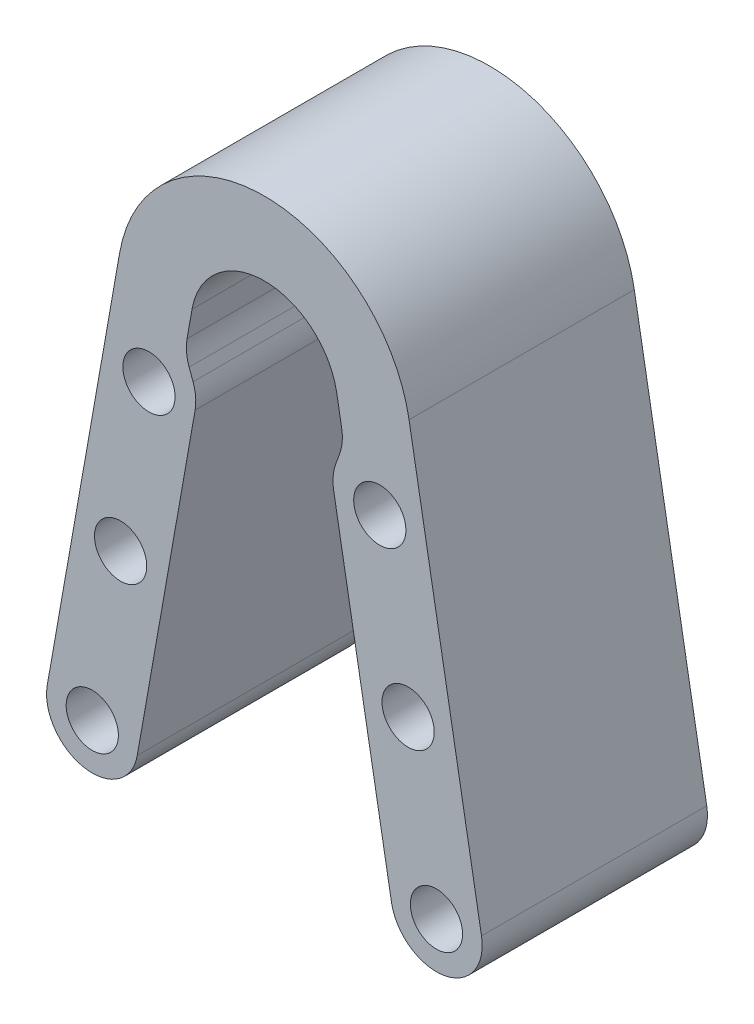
ISO-10303-21;
HEADER;
FILE_DESCRIPTION(('STEP AP214'),'2;1');
FILE_NAME('part.step','',(''),(''),'','','');
FILE_SCHEMA(('AUTOMOTIVE_DESIGN { 1 0 10303 214 1 1 1 1 }'));
ENDSEC;
DATA;
#1=APPLICATION_CONTEXT('core data for automotive mechanical design processes');
#2=APPLICATION_PROTOCOL_DEFINITION('international standard','automotive_design',2000,#1);
#3=PRODUCT_CONTEXT('',#1,'mechanical');
#4=PRODUCT('Part','Part','',(#3));
#5=PRODUCT_RELATED_PRODUCT_CATEGORY('part','',(#4));
#6=PRODUCT_DEFINITION_FORMATION('','',#4);
#7=PRODUCT_DEFINITION_CONTEXT('part definition',#1,'design');
#8=PRODUCT_DEFINITION('design','',#6,#7);
#9=PRODUCT_DEFINITION_SHAPE('','',#8);
#10=(LENGTH_UNIT() NAMED_UNIT(*) SI_UNIT(.MILLI.,.METRE.));
#11=(NAMED_UNIT(*) PLANE_ANGLE_UNIT() SI_UNIT($,.RADIAN.));
#12=(NAMED_UNIT(*) SI_UNIT($,.STERADIAN.) SOLID_ANGLE_UNIT());
#13=UNCERTAINTY_MEASURE_WITH_UNIT(LENGTH_MEASURE(1.E-05),#10,'distance_accuracy_value','');
#14=(GEOMETRIC_REPRESENTATION_CONTEXT(3) GLOBAL_UNCERTAINTY_ASSIGNED_CONTEXT((#13)) GLOBAL_UNIT_ASSIGNED_CONTEXT((#10,
#11,#12)) REPRESENTATION_CONTEXT('',''));
#15=CARTESIAN_POINT('',(0.,0.,0.));
#16=DIRECTION('',(0.,0.,1.));
#17=DIRECTION('',(1.,0.,0.));
#18=AXIS2_PLACEMENT_3D('',#15,#16,#17);
#19=CARTESIAN_POINT('',(0.,0.,6.9));
#20=DIRECTION('',(0.,0.,-1.));
#21=DIRECTION('',(-1.,0.,0.));
#22=AXIS2_PLACEMENT_3D('',#19,#20,#21);
#23=PLANE('',#22);
#24=DIRECTION('',(0.173648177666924,0.984807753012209,0.));
#25=VECTOR('',#24,1.);
#26=CARTESIAN_POINT('',(-4.11331101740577,-3.74792634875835,6.9));
#27=LINE('',#26,#25);
#28=CARTESIAN_POINT('',(-7.78601473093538,-24.5768641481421,6.9));
#29=VERTEX_POINT('',#28);
#30=CARTESIAN_POINT('',(-4.24359190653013,-4.48678598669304,6.9));
#31=VERTEX_POINT('',#30);
#32=EDGE_CURVE('E240',#29,#31,#27,.T.);
#33=ORIENTED_EDGE('',*,*,#32,.T.);
#34=CARTESIAN_POINT('',(-7.00105361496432,-4.00057108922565,6.9));
#35=DIRECTION('',(0.,0.,-1.));
#36=DIRECTION('',(-1.,0.,0.));
#37=AXIS2_PLACEMENT_3D('',#34,#35,#36);
#38=CIRCLE('',#37,2.8);
#39=CARTESIAN_POINT('',(-4.36991427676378,-3.04291468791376,6.9));
#40=VERTEX_POINT('',#39);
#41=EDGE_CURVE('E206',#31,#40,#38,.F.);
#42=ORIENTED_EDGE('',*,*,#41,.T.);
#43=DIRECTION('',(-0.342020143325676,0.939692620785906,0.));
#44=VECTOR('',#43,1.);
#45=CARTESIAN_POINT('',(-4.86575533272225,-1.68060258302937,6.9));
#46=LINE('',#45,#44);
#47=CARTESIAN_POINT('',(-4.60915207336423,-2.38561424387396,6.9));
#48=VERTEX_POINT('',#47);
#49=EDGE_CURVE('E233',#40,#48,#46,.T.);
#50=ORIENTED_EDGE('',*,*,#49,.T.);
#51=CARTESIAN_POINT('',(-1.9780127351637,-1.42795784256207,6.9));
#52=DIRECTION('',(0.,0.,-1.));
#53=DIRECTION('',(-1.,0.,0.));
#54=AXIS2_PLACEMENT_3D('',#51,#52,#53);
#55=CIRCLE('',#54,2.8);
#56=CARTESIAN_POINT('',(-4.73547444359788,-0.94174294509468,6.9));
#57=VERTEX_POINT('',#56);
#58=EDGE_CURVE('E11',#48,#57,#55,.T.);
#59=ORIENTED_EDGE('',*,*,#58,.T.);
#60=DIRECTION('',(0.173648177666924,0.984807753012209,0.));
#61=VECTOR('',#60,1.);
#62=CARTESIAN_POINT('',(-4.43163488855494,0.781416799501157,6.9));
#63=LINE('',#62,#61);
#64=CARTESIAN_POINT('',(-4.43163488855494,0.781416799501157,6.9));
#65=VERTEX_POINT('',#64);
#66=EDGE_CURVE('E170',#57,#65,#63,.T.);
#67=ORIENTED_EDGE('',*,*,#66,.T.);
#68=CARTESIAN_POINT('',(0.,0.,6.9));
#69=DIRECTION('',(0.,0.,-1.));
#70=DIRECTION('',(-1.,0.,0.));
#71=AXIS2_PLACEMENT_3D('',#68,#69,#70);
#72=CIRCLE('',#71,4.5);
#73=CARTESIAN_POINT('',(4.43163488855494,0.781416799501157,6.9));
#74=VERTEX_POINT('',#73);
#75=EDGE_CURVE('E165',#65,#74,#72,.T.);
#76=ORIENTED_EDGE('',*,*,#75,.T.);
#77=DIRECTION('',(0.173648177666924,-0.984807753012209,0.));
#78=VECTOR('',#77,1.);
#79=CARTESIAN_POINT('',(4.43163488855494,0.781416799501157,6.9));
#80=LINE('',#79,#78);
#81=CARTESIAN_POINT('',(4.73547444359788,-0.941742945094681,6.9));
#82=VERTEX_POINT('',#81);
#83=EDGE_CURVE('E154',#74,#82,#80,.T.);
#84=ORIENTED_EDGE('',*,*,#83,.T.);
#85=CARTESIAN_POINT('',(1.9780127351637,-1.42795784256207,6.9));
#86=DIRECTION('',(0.,0.,-1.));
#87=DIRECTION('',(-1.,0.,0.));
#88=AXIS2_PLACEMENT_3D('',#85,#86,#87);
#89=CIRCLE('',#88,2.8);
#90=CARTESIAN_POINT('',(4.60915207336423,-2.38561424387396,6.9));
#91=VERTEX_POINT('',#90);
#92=EDGE_CURVE('E213',#82,#91,#89,.T.);
#93=ORIENTED_EDGE('',*,*,#92,.T.);
#94=DIRECTION('',(-0.342020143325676,-0.939692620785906,0.));
#95=VECTOR('',#94,1.);
#96=CARTESIAN_POINT('',(4.86575533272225,-1.68060258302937,6.9));
#97=LINE('',#96,#95);
#98=CARTESIAN_POINT('',(4.36991427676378,-3.04291468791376,6.9));
#99=VERTEX_POINT('',#98);
#100=EDGE_CURVE('E164',#91,#99,#97,.T.);
#101=ORIENTED_EDGE('',*,*,#100,.T.);
#102=CARTESIAN_POINT('',(7.00105361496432,-4.00057108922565,6.9));
#103=DIRECTION('',(0.,0.,-1.));
#104=DIRECTION('',(-1.,0.,0.));
#105=AXIS2_PLACEMENT_3D('',#102,#103,#104);
#106=CIRCLE('',#105,2.8);
#107=CARTESIAN_POINT('',(4.24359190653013,-4.48678598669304,6.9));
#108=VERTEX_POINT('',#107);
#109=EDGE_CURVE('E54',#99,#108,#106,.F.);
#110=ORIENTED_EDGE('',*,*,#109,.T.);
#111=DIRECTION('',(0.173648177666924,-0.984807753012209,0.));
#112=VECTOR('',#111,1.);
#113=CARTESIAN_POINT('',(4.11331101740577,-3.74792634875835,6.9));
#114=LINE('',#113,#112);
#115=CARTESIAN_POINT('',(7.78601473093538,-24.5768641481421,6.9));
#116=VERTEX_POINT('',#115);
#117=EDGE_CURVE('E523',#108,#116,#114,.T.);
#118=ORIENTED_EDGE('',*,*,#117,.T.);
#119=CARTESIAN_POINT('',(10.5434764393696,-24.0906492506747,6.9));
#120=DIRECTION('',(0.,0.,1.));
#121=DIRECTION('',(1.,0.,0.));
#122=AXIS2_PLACEMENT_3D('',#119,#120,#121);
#123=CIRCLE('',#122,2.8);
#124=CARTESIAN_POINT('',(13.3009381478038,-23.6044343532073,6.9));
#125=VERTEX_POINT('',#124);
#126=EDGE_CURVE('E527',#116,#125,#123,.T.);
#127=ORIENTED_EDGE('',*,*,#126,.T.);
#128=DIRECTION('',(-0.173648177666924,0.984807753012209,0.));
#129=VECTOR('',#128,1.);
#130=CARTESIAN_POINT('',(13.3009381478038,-23.6044343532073,6.9));
#131=LINE('',#130,#129);
#132=CARTESIAN_POINT('',(8.86326977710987,1.56283359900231,6.9));
#133=VERTEX_POINT('',#132);
#134=EDGE_CURVE('E282',#125,#133,#131,.T.);
#135=ORIENTED_EDGE('',*,*,#134,.T.);
#136=CARTESIAN_POINT('',(0.,0.,6.9));
#137=DIRECTION('',(0.,0.,1.));
#138=DIRECTION('',(-1.,0.,0.));
#139=AXIS2_PLACEMENT_3D('',#136,#137,#138);
#140=CIRCLE('',#139,8.99999999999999);
#141=CARTESIAN_POINT('',(-8.86326977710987,1.56283359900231,6.9));
#142=VERTEX_POINT('',#141);
#143=EDGE_CURVE('E301',#133,#142,#140,.T.);
#144=ORIENTED_EDGE('',*,*,#143,.T.);
#145=DIRECTION('',(-0.173648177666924,-0.984807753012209,0.));
#146=VECTOR('',#145,1.);
#147=CARTESIAN_POINT('',(-13.3009381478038,-23.6044343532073,6.9));
#148=LINE('',#147,#146);
#149=CARTESIAN_POINT('',(-13.3009381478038,-23.6044343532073,6.9));
#150=VERTEX_POINT('',#149);
#151=EDGE_CURVE('E298',#142,#150,#148,.T.);
#152=ORIENTED_EDGE('',*,*,#151,.T.);
#153=CARTESIAN_POINT('',(-10.5434764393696,-24.0906492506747,6.9));
#154=DIRECTION('',(0.,0.,1.));
#155=DIRECTION('',(-1.,0.,0.));
#156=AXIS2_PLACEMENT_3D('',#153,#154,#155);
#157=CIRCLE('',#156,2.8);
#158=EDGE_CURVE('E300',#150,#29,#157,.T.);
#159=ORIENTED_EDGE('',*,*,#158,.T.);
#160=EDGE_LOOP('',(#33,#42,#50,#59,#67,#76,#84,#93,#101,#110,#118,#127,#135,#144,#152,#159));
#161=FACE_BOUND('',#160,.T.);
#162=CARTESIAN_POINT('',(10.5434764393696,-24.0906492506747,6.9));
#163=DIRECTION('',(0.,0.,1.));
#164=DIRECTION('',(1.,0.,0.));
#165=AXIS2_PLACEMENT_3D('',#162,#163,#164);
#166=CIRCLE('',#165,1.60000000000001);
#167=CARTESIAN_POINT('',(8.94347643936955,-24.0906492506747,6.9));
#168=VERTEX_POINT('',#167);
#169=EDGE_CURVE('E246',#168,#168,#166,.T.);
#170=ORIENTED_EDGE('',*,*,#169,.F.);
#171=EDGE_LOOP('',(#170));
#172=FACE_BOUND('',#171,.T.);
#173=CARTESIAN_POINT('',(8.80699466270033,-14.2425717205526,6.9));
#174=DIRECTION('',(0.,0.,1.));
#175=DIRECTION('',(1.,0.,0.));
#176=AXIS2_PLACEMENT_3D('',#173,#174,#175);
#177=CIRCLE('',#176,1.60000000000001);
#178=CARTESIAN_POINT('',(7.20699466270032,-14.2425717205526,6.9));
#179=VERTEX_POINT('',#178);
#180=EDGE_CURVE('E534',#179,#179,#177,.T.);
#181=ORIENTED_EDGE('',*,*,#180,.F.);
#182=EDGE_LOOP('',(#181));
#183=FACE_BOUND('',#182,.T.);
#184=CARTESIAN_POINT('',(7.07051288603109,-4.39449419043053,6.9));
#185=DIRECTION('',(0.,0.,1.));
#186=DIRECTION('',(1.,0.,0.));
#187=AXIS2_PLACEMENT_3D('',#184,#185,#186);
#188=CIRCLE('',#187,1.60000000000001);
#189=CARTESIAN_POINT('',(5.47051288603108,-4.39449419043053,6.9));
#190=VERTEX_POINT('',#189);
#191=EDGE_CURVE('E540',#190,#190,#188,.T.);
#192=ORIENTED_EDGE('',*,*,#191,.F.);
#193=EDGE_LOOP('',(#192));
#194=FACE_BOUND('',#193,.T.);
#195=CARTESIAN_POINT('',(-7.07051288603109,-4.39449419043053,6.9));
#196=DIRECTION('',(0.,0.,1.));
#197=DIRECTION('',(-1.,0.,0.));
#198=AXIS2_PLACEMENT_3D('',#195,#196,#197);
#199=CIRCLE('',#198,1.60000000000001);
#200=CARTESIAN_POINT('',(-8.67051288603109,-4.39449419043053,6.9));
#201=VERTEX_POINT('',#200);
#202=EDGE_CURVE('E546',#201,#201,#199,.T.);
#203=ORIENTED_EDGE('',*,*,#202,.F.);
#204=EDGE_LOOP('',(#203));
#205=FACE_BOUND('',#204,.T.);
#206=CARTESIAN_POINT('',(-8.80699466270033,-14.2425717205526,6.9));
#207=DIRECTION('',(0.,0.,1.));
#208=DIRECTION('',(-1.,0.,0.));
#209=AXIS2_PLACEMENT_3D('',#206,#207,#208);
#210=CIRCLE('',#209,1.60000000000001);
#211=CARTESIAN_POINT('',(-10.4069946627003,-14.2425717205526,6.9));
#212=VERTEX_POINT('',#211);
#213=EDGE_CURVE('E552',#212,#212,#210,.T.);
#214=ORIENTED_EDGE('',*,*,#213,.F.);
#215=EDGE_LOOP('',(#214));
#216=FACE_BOUND('',#215,.T.);
#217=CARTESIAN_POINT('',(-10.5434764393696,-24.0906492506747,6.9));
#218=DIRECTION('',(0.,0.,1.));
#219=DIRECTION('',(-1.,0.,0.));
#220=AXIS2_PLACEMENT_3D('',#217,#218,#219);
#221=CIRCLE('',#220,1.60000000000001);
#222=CARTESIAN_POINT('',(-12.1434764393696,-24.0906492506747,6.9));
#223=VERTEX_POINT('',#222);
#224=EDGE_CURVE('E558',#223,#223,#221,.T.);
#225=ORIENTED_EDGE('',*,*,#224,.F.);
#226=EDGE_LOOP('',(#225));
#227=FACE_BOUND('',#226,.T.);
#228=ADVANCED_FACE('F39',(#161,#172,#183,#194,#205,#216,#227),#23,.F.);
#229=CARTESIAN_POINT('',(0.,0.,-6.9));
#230=DIRECTION('',(0.,0.,-1.));
#231=DIRECTION('',(-1.,0.,0.));
#232=AXIS2_PLACEMENT_3D('',#229,#230,#231);
#233=PLANE('',#232);
#234=CARTESIAN_POINT('',(-8.80699466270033,-14.2425717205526,-6.9));
#235=DIRECTION('',(0.,0.,1.));
#236=DIRECTION('',(-1.,0.,0.));
#237=AXIS2_PLACEMENT_3D('',#234,#235,#236);
#238=CIRCLE('',#237,1.60000000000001);
#239=CARTESIAN_POINT('',(-10.4069946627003,-14.2425717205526,-6.9));
#240=VERTEX_POINT('',#239);
#241=EDGE_CURVE('E555',#240,#240,#238,.T.);
#242=ORIENTED_EDGE('',*,*,#241,.T.);
#243=EDGE_LOOP('',(#242));
#244=FACE_BOUND('',#243,.T.);
#245=CARTESIAN_POINT('',(7.07051288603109,-4.39449419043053,-6.9));
#246=DIRECTION('',(0.,0.,1.));
#247=DIRECTION('',(1.,0.,0.));
#248=AXIS2_PLACEMENT_3D('',#245,#246,#247);
#249=CIRCLE('',#248,1.60000000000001);
#250=CARTESIAN_POINT('',(5.47051288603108,-4.39449419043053,-6.9));
#251=VERTEX_POINT('',#250);
#252=EDGE_CURVE('E543',#251,#251,#249,.T.);
#253=ORIENTED_EDGE('',*,*,#252,.T.);
#254=EDGE_LOOP('',(#253));
#255=FACE_BOUND('',#254,.T.);
#256=CARTESIAN_POINT('',(10.5434764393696,-24.0906492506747,-6.9));
#257=DIRECTION('',(0.,0.,1.));
#258=DIRECTION('',(1.,0.,0.));
#259=AXIS2_PLACEMENT_3D('',#256,#257,#258);
#260=CIRCLE('',#259,1.60000000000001);
#261=CARTESIAN_POINT('',(8.94347643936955,-24.0906492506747,-6.9));
#262=VERTEX_POINT('',#261);
#263=EDGE_CURVE('E531',#262,#262,#260,.T.);
#264=ORIENTED_EDGE('',*,*,#263,.T.);
#265=EDGE_LOOP('',(#264));
#266=FACE_BOUND('',#265,.T.);
#267=DIRECTION('',(-0.342020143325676,0.939692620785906,0.));
#268=VECTOR('',#267,1.);
#269=CARTESIAN_POINT('',(-4.86575533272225,-1.68060258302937,-6.9));
#270=LINE('',#269,#268);
#271=CARTESIAN_POINT('',(-4.36991427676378,-3.04291468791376,-6.9));
#272=VERTEX_POINT('',#271);
#273=CARTESIAN_POINT('',(-4.60915207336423,-2.38561424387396,-6.9));
#274=VERTEX_POINT('',#273);
#275=EDGE_CURVE('E220',#272,#274,#270,.T.);
#276=ORIENTED_EDGE('',*,*,#275,.F.);
#277=CARTESIAN_POINT('',(-7.00105361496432,-4.00057108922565,-6.9));
#278=DIRECTION('',(0.,0.,-1.));
#279=DIRECTION('',(-1.,0.,0.));
#280=AXIS2_PLACEMENT_3D('',#277,#278,#279);
#281=CIRCLE('',#280,2.8);
#282=CARTESIAN_POINT('',(-4.24359190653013,-4.48678598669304,-6.9));
#283=VERTEX_POINT('',#282);
#284=EDGE_CURVE('E202',#272,#283,#281,.T.);
#285=ORIENTED_EDGE('',*,*,#284,.T.);
#286=DIRECTION('',(0.173648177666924,0.984807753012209,0.));
#287=VECTOR('',#286,1.);
#288=CARTESIAN_POINT('',(-4.11331101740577,-3.74792634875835,-6.9));
#289=LINE('',#288,#287);
#290=CARTESIAN_POINT('',(-7.78601473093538,-24.5768641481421,-6.9));
#291=VERTEX_POINT('',#290);
#292=EDGE_CURVE('E229',#291,#283,#289,.T.);
#293=ORIENTED_EDGE('',*,*,#292,.F.);
#294=CARTESIAN_POINT('',(-10.5434764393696,-24.0906492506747,-6.9));
#295=DIRECTION('',(0.,0.,1.));
#296=DIRECTION('',(-1.,0.,0.));
#297=AXIS2_PLACEMENT_3D('',#294,#295,#296);
#298=CIRCLE('',#297,2.8);
#299=CARTESIAN_POINT('',(-13.3009381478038,-23.6044343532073,-6.9));
#300=VERTEX_POINT('',#299);
#301=EDGE_CURVE('E261',#300,#291,#298,.T.);
#302=ORIENTED_EDGE('',*,*,#301,.F.);
#303=DIRECTION('',(-0.173648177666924,-0.984807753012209,0.));
#304=VECTOR('',#303,1.);
#305=CARTESIAN_POINT('',(-13.3009381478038,-23.6044343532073,-6.9));
#306=LINE('',#305,#304);
#307=CARTESIAN_POINT('',(-8.86326977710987,1.56283359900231,-6.9));
#308=VERTEX_POINT('',#307);
#309=EDGE_CURVE('E259',#308,#300,#306,.T.);
#310=ORIENTED_EDGE('',*,*,#309,.F.);
#311=CARTESIAN_POINT('',(0.,0.,-6.9));
#312=DIRECTION('',(0.,0.,1.));
#313=DIRECTION('',(-1.,0.,0.));
#314=AXIS2_PLACEMENT_3D('',#311,#312,#313);
#315=CIRCLE('',#314,8.99999999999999);
#316=CARTESIAN_POINT('',(8.86326977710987,1.56283359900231,-6.9));
#317=VERTEX_POINT('',#316);
#318=EDGE_CURVE('E257',#317,#308,#315,.T.);
#319=ORIENTED_EDGE('',*,*,#318,.F.);
#320=DIRECTION('',(-0.173648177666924,0.984807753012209,0.));
#321=VECTOR('',#320,1.);
#322=CARTESIAN_POINT('',(13.3009381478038,-23.6044343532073,-6.9));
#323=LINE('',#322,#321);
#324=CARTESIAN_POINT('',(13.3009381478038,-23.6044343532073,-6.9));
#325=VERTEX_POINT('',#324);
#326=EDGE_CURVE('E255',#325,#317,#323,.T.);
#327=ORIENTED_EDGE('',*,*,#326,.F.);
#328=CARTESIAN_POINT('',(10.5434764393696,-24.0906492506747,-6.9));
#329=DIRECTION('',(0.,0.,1.));
#330=DIRECTION('',(1.,0.,0.));
#331=AXIS2_PLACEMENT_3D('',#328,#329,#330);
#332=CIRCLE('',#331,2.8);
#333=CARTESIAN_POINT('',(7.78601473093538,-24.5768641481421,-6.9));
#334=VERTEX_POINT('',#333);
#335=EDGE_CURVE('E253',#334,#325,#332,.T.);
#336=ORIENTED_EDGE('',*,*,#335,.F.);
#337=DIRECTION('',(0.173648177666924,-0.984807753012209,0.));
#338=VECTOR('',#337,1.);
#339=CARTESIAN_POINT('',(4.11331101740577,-3.74792634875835,-6.9));
#340=LINE('',#339,#338);
#341=CARTESIAN_POINT('',(4.24359190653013,-4.48678598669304,-6.9));
#342=VERTEX_POINT('',#341);
#343=EDGE_CURVE('E251',#342,#334,#340,.T.);
#344=ORIENTED_EDGE('',*,*,#343,.F.);
#345=CARTESIAN_POINT('',(7.00105361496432,-4.00057108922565,-6.9));
#346=DIRECTION('',(0.,0.,-1.));
#347=DIRECTION('',(-1.,0.,0.));
#348=AXIS2_PLACEMENT_3D('',#345,#346,#347);
#349=CIRCLE('',#348,2.8);
#350=CARTESIAN_POINT('',(4.36991427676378,-3.04291468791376,-6.9));
#351=VERTEX_POINT('',#350);
#352=EDGE_CURVE('E200',#342,#351,#349,.T.);
#353=ORIENTED_EDGE('',*,*,#352,.T.);
#354=DIRECTION('',(-0.342020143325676,-0.939692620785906,0.));
#355=VECTOR('',#354,1.);
#356=CARTESIAN_POINT('',(4.86575533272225,-1.68060258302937,-6.9));
#357=LINE('',#356,#355);
#358=CARTESIAN_POINT('',(4.60915207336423,-2.38561424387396,-6.9));
#359=VERTEX_POINT('',#358);
#360=EDGE_CURVE('E248',#359,#351,#357,.T.);
#361=ORIENTED_EDGE('',*,*,#360,.F.);
#362=CARTESIAN_POINT('',(1.9780127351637,-1.42795784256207,-6.9));
#363=DIRECTION('',(0.,0.,-1.));
#364=DIRECTION('',(-1.,0.,0.));
#365=AXIS2_PLACEMENT_3D('',#362,#363,#364);
#366=CIRCLE('',#365,2.8);
#367=CARTESIAN_POINT('',(4.73547444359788,-0.941742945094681,-6.9));
#368=VERTEX_POINT('',#367);
#369=EDGE_CURVE('E211',#359,#368,#366,.F.);
#370=ORIENTED_EDGE('',*,*,#369,.T.);
#371=DIRECTION('',(0.173648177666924,-0.984807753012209,0.));
#372=VECTOR('',#371,1.);
#373=CARTESIAN_POINT('',(4.43163488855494,0.781416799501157,-6.9));
#374=LINE('',#373,#372);
#375=CARTESIAN_POINT('',(4.43163488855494,0.781416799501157,-6.9));
#376=VERTEX_POINT('',#375);
#377=EDGE_CURVE('E245',#376,#368,#374,.T.);
#378=ORIENTED_EDGE('',*,*,#377,.F.);
#379=CARTESIAN_POINT('',(0.,0.,-6.9));
#380=DIRECTION('',(0.,0.,-1.));
#381=DIRECTION('',(-1.,0.,0.));
#382=AXIS2_PLACEMENT_3D('',#379,#380,#381);
#383=CIRCLE('',#382,4.5);
#384=CARTESIAN_POINT('',(-4.43163488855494,0.781416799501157,-6.9));
#385=VERTEX_POINT('',#384);
#386=EDGE_CURVE('E178',#385,#376,#383,.T.);
#387=ORIENTED_EDGE('',*,*,#386,.F.);
#388=DIRECTION('',(0.173648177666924,0.984807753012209,0.));
#389=VECTOR('',#388,1.);
#390=CARTESIAN_POINT('',(-4.43163488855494,0.781416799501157,-6.9));
#391=LINE('',#390,#389);
#392=CARTESIAN_POINT('',(-4.73547444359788,-0.94174294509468,-6.9));
#393=VERTEX_POINT('',#392);
#394=EDGE_CURVE('E174',#393,#385,#391,.T.);
#395=ORIENTED_EDGE('',*,*,#394,.F.);
#396=CARTESIAN_POINT('',(-1.9780127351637,-1.42795784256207,-6.9));
#397=DIRECTION('',(0.,0.,-1.));
#398=DIRECTION('',(-1.,0.,0.));
#399=AXIS2_PLACEMENT_3D('',#396,#397,#398);
#400=CIRCLE('',#399,2.8);
#401=EDGE_CURVE('E47',#393,#274,#400,.F.);
#402=ORIENTED_EDGE('',*,*,#401,.T.);
#403=EDGE_LOOP('',(#276,#285,#293,#302,#310,#319,#327,#336,#344,#353,#361,#370,#378,#387,#395,#402));
#404=FACE_BOUND('',#403,.T.);
#405=CARTESIAN_POINT('',(8.80699466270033,-14.2425717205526,-6.9));
#406=DIRECTION('',(0.,0.,1.));
#407=DIRECTION('',(1.,0.,0.));
#408=AXIS2_PLACEMENT_3D('',#405,#406,#407);
#409=CIRCLE('',#408,1.60000000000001);
#410=CARTESIAN_POINT('',(7.20699466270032,-14.2425717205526,-6.9));
#411=VERTEX_POINT('',#410);
#412=EDGE_CURVE('E537',#411,#411,#409,.T.);
#413=ORIENTED_EDGE('',*,*,#412,.T.);
#414=EDGE_LOOP('',(#413));
#415=FACE_BOUND('',#414,.T.);
#416=CARTESIAN_POINT('',(-7.07051288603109,-4.39449419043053,-6.9));
#417=DIRECTION('',(0.,0.,1.));
#418=DIRECTION('',(-1.,0.,0.));
#419=AXIS2_PLACEMENT_3D('',#416,#417,#418);
#420=CIRCLE('',#419,1.60000000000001);
#421=CARTESIAN_POINT('',(-8.67051288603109,-4.39449419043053,-6.9));
#422=VERTEX_POINT('',#421);
#423=EDGE_CURVE('E549',#422,#422,#420,.T.);
#424=ORIENTED_EDGE('',*,*,#423,.T.);
#425=EDGE_LOOP('',(#424));
#426=FACE_BOUND('',#425,.T.);
#427=CARTESIAN_POINT('',(-10.5434764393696,-24.0906492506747,-6.9));
#428=DIRECTION('',(0.,0.,1.));
#429=DIRECTION('',(-1.,0.,0.));
#430=AXIS2_PLACEMENT_3D('',#427,#428,#429);
#431=CIRCLE('',#430,1.60000000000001);
#432=CARTESIAN_POINT('',(-12.1434764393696,-24.0906492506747,-6.9));
#433=VERTEX_POINT('',#432);
#434=EDGE_CURVE('E561',#433,#433,#431,.T.);
#435=ORIENTED_EDGE('',*,*,#434,.T.);
#436=EDGE_LOOP('',(#435));
#437=FACE_BOUND('',#436,.T.);
#438=ADVANCED_FACE('F218',(#244,#255,#266,#404,#415,#426,#437),#233,.T.);
#439=CARTESIAN_POINT('',(0.,0.,6.9));
#440=DIRECTION('',(0.,0.,-1.));
#441=DIRECTION('',(-1.,0.,0.));
#442=AXIS2_PLACEMENT_3D('',#439,#440,#441);
#443=CYLINDRICAL_SURFACE('',#442,4.5);
#444=ORIENTED_EDGE('',*,*,#386,.T.);
#445=DIRECTION('',(0.,0.,-1.));
#446=VECTOR('',#445,1.);
#447=CARTESIAN_POINT('',(4.43163488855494,0.781416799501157,6.9));
#448=LINE('',#447,#446);
#449=EDGE_CURVE('E159',#74,#376,#448,.T.);
#450=ORIENTED_EDGE('',*,*,#449,.F.);
#451=ORIENTED_EDGE('',*,*,#75,.F.);
#452=DIRECTION('',(0.,0.,-1.));
#453=VECTOR('',#452,1.);
#454=CARTESIAN_POINT('',(-4.43163488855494,0.781416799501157,6.9));
#455=LINE('',#454,#453);
#456=EDGE_CURVE('E236',#65,#385,#455,.T.);
#457=ORIENTED_EDGE('',*,*,#456,.T.);
#458=EDGE_LOOP('',(#444,#450,#451,#457));
#459=FACE_BOUND('',#458,.T.);
#460=ADVANCED_FACE('F176',(#459),#443,.F.);
#461=CARTESIAN_POINT('',(4.43163488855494,0.781416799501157,6.9));
#462=DIRECTION('',(0.984807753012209,0.173648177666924,0.));
#463=DIRECTION('',(-0.173648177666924,0.984807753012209,0.));
#464=AXIS2_PLACEMENT_3D('',#461,#462,#463);
#465=PLANE('',#464);
#466=ORIENTED_EDGE('',*,*,#377,.T.);
#467=DIRECTION('',(0.,0.,-1.));
#468=VECTOR('',#467,1.);
#469=CARTESIAN_POINT('',(4.73547444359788,-0.941742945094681,6.9));
#470=LINE('',#469,#468);
#471=EDGE_CURVE('E162',#368,#82,#470,.F.);
#472=ORIENTED_EDGE('',*,*,#471,.T.);
#473=ORIENTED_EDGE('',*,*,#83,.F.);
#474=ORIENTED_EDGE('',*,*,#449,.T.);
#475=EDGE_LOOP('',(#466,#472,#473,#474));
#476=FACE_BOUND('',#475,.T.);
#477=ADVANCED_FACE('F157',(#476),#465,.F.);
#478=CARTESIAN_POINT('',(4.86575533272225,-1.68060258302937,6.9));
#479=DIRECTION('',(0.939692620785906,-0.342020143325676,0.));
#480=DIRECTION('',(0.342020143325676,0.939692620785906,0.));
#481=AXIS2_PLACEMENT_3D('',#478,#479,#480);
#482=PLANE('',#481);
#483=ORIENTED_EDGE('',*,*,#100,.F.);
#484=DIRECTION('',(0.,0.,-1.));
#485=VECTOR('',#484,1.);
#486=CARTESIAN_POINT('',(4.60915207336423,-2.38561424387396,-6.9));
#487=LINE('',#486,#485);
#488=EDGE_CURVE('E182',#91,#359,#487,.T.);
#489=ORIENTED_EDGE('',*,*,#488,.T.);
#490=ORIENTED_EDGE('',*,*,#360,.T.);
#491=DIRECTION('',(0.,0.,-1.));
#492=VECTOR('',#491,1.);
#493=CARTESIAN_POINT('',(4.36991427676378,-3.04291468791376,6.9));
#494=LINE('',#493,#492);
#495=EDGE_CURVE('E179',#351,#99,#494,.F.);
#496=ORIENTED_EDGE('',*,*,#495,.T.);
#497=EDGE_LOOP('',(#483,#489,#490,#496));
#498=FACE_BOUND('',#497,.T.);
#499=ADVANCED_FACE('F475',(#498),#482,.F.);
#500=CARTESIAN_POINT('',(4.11331101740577,-3.74792634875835,6.9));
#501=DIRECTION('',(0.984807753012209,0.173648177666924,0.));
#502=DIRECTION('',(-0.173648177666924,0.984807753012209,0.));
#503=AXIS2_PLACEMENT_3D('',#500,#501,#502);
#504=PLANE('',#503);
#505=ORIENTED_EDGE('',*,*,#117,.F.);
#506=DIRECTION('',(0.,0.,-1.));
#507=VECTOR('',#506,1.);
#508=CARTESIAN_POINT('',(4.24359190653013,-4.48678598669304,6.9));
#509=LINE('',#508,#507);
#510=EDGE_CURVE('E208',#108,#342,#509,.T.);
#511=ORIENTED_EDGE('',*,*,#510,.T.);
#512=ORIENTED_EDGE('',*,*,#343,.T.);
#513=DIRECTION('',(0.,0.,-1.));
#514=VECTOR('',#513,1.);
#515=CARTESIAN_POINT('',(7.78601473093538,-24.5768641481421,6.9));
#516=LINE('',#515,#514);
#517=EDGE_CURVE('E180',#116,#334,#516,.T.);
#518=ORIENTED_EDGE('',*,*,#517,.F.);
#519=EDGE_LOOP('',(#505,#511,#512,#518));
#520=FACE_BOUND('',#519,.T.);
#521=ADVANCED_FACE('F468',(#520),#504,.F.);
#522=CARTESIAN_POINT('',(10.5434764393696,-24.0906492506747,6.9));
#523=DIRECTION('',(0.,0.,-1.));
#524=DIRECTION('',(-1.,0.,0.));
#525=AXIS2_PLACEMENT_3D('',#522,#523,#524);
#526=CYLINDRICAL_SURFACE('',#525,2.8);
#527=ORIENTED_EDGE('',*,*,#335,.T.);
#528=DIRECTION('',(0.,0.,-1.));
#529=VECTOR('',#528,1.);
#530=CARTESIAN_POINT('',(13.3009381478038,-23.6044343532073,6.9));
#531=LINE('',#530,#529);
#532=EDGE_CURVE('E185',#125,#325,#531,.T.);
#533=ORIENTED_EDGE('',*,*,#532,.F.);
#534=ORIENTED_EDGE('',*,*,#126,.F.);
#535=ORIENTED_EDGE('',*,*,#517,.T.);
#536=EDGE_LOOP('',(#527,#533,#534,#535));
#537=FACE_BOUND('',#536,.T.);
#538=ADVANCED_FACE('F460',(#537),#526,.T.);
#539=CARTESIAN_POINT('',(13.3009381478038,-23.6044343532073,6.9));
#540=DIRECTION('',(-0.984807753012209,-0.173648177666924,0.));
#541=DIRECTION('',(0.173648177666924,-0.984807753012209,0.));
#542=AXIS2_PLACEMENT_3D('',#539,#540,#541);
#543=PLANE('',#542);
#544=ORIENTED_EDGE('',*,*,#326,.T.);
#545=DIRECTION('',(0.,0.,-1.));
#546=VECTOR('',#545,1.);
#547=CARTESIAN_POINT('',(8.86326977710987,1.56283359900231,6.9));
#548=LINE('',#547,#546);
#549=EDGE_CURVE('E273',#133,#317,#548,.T.);
#550=ORIENTED_EDGE('',*,*,#549,.F.);
#551=ORIENTED_EDGE('',*,*,#134,.F.);
#552=ORIENTED_EDGE('',*,*,#532,.T.);
#553=EDGE_LOOP('',(#544,#550,#551,#552));
#554=FACE_BOUND('',#553,.T.);
#555=ADVANCED_FACE('F280',(#554),#543,.F.);
#556=CARTESIAN_POINT('',(0.,0.,6.9));
#557=DIRECTION('',(0.,0.,-1.));
#558=DIRECTION('',(-1.,0.,0.));
#559=AXIS2_PLACEMENT_3D('',#556,#557,#558);
#560=CYLINDRICAL_SURFACE('',#559,8.99999999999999);
#561=ORIENTED_EDGE('',*,*,#318,.T.);
#562=DIRECTION('',(0.,0.,-1.));
#563=VECTOR('',#562,1.);
#564=CARTESIAN_POINT('',(-8.86326977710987,1.56283359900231,6.9));
#565=LINE('',#564,#563);
#566=EDGE_CURVE('E270',#142,#308,#565,.T.);
#567=ORIENTED_EDGE('',*,*,#566,.F.);
#568=ORIENTED_EDGE('',*,*,#143,.F.);
#569=ORIENTED_EDGE('',*,*,#549,.T.);
#570=EDGE_LOOP('',(#561,#567,#568,#569));
#571=FACE_BOUND('',#570,.T.);
#572=ADVANCED_FACE('F292',(#571),#560,.T.);
#573=CARTESIAN_POINT('',(-13.3009381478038,-23.6044343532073,6.9));
#574=DIRECTION('',(0.984807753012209,-0.173648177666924,0.));
#575=DIRECTION('',(0.173648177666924,0.984807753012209,0.));
#576=AXIS2_PLACEMENT_3D('',#573,#574,#575);
#577=PLANE('',#576);
#578=ORIENTED_EDGE('',*,*,#309,.T.);
#579=DIRECTION('',(0.,0.,-1.));
#580=VECTOR('',#579,1.);
#581=CARTESIAN_POINT('',(-13.3009381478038,-23.6044343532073,6.9));
#582=LINE('',#581,#580);
#583=EDGE_CURVE('E267',#150,#300,#582,.T.);
#584=ORIENTED_EDGE('',*,*,#583,.F.);
#585=ORIENTED_EDGE('',*,*,#151,.F.);
#586=ORIENTED_EDGE('',*,*,#566,.T.);
#587=EDGE_LOOP('',(#578,#584,#585,#586));
#588=FACE_BOUND('',#587,.T.);
#589=ADVANCED_FACE('F296',(#588),#577,.F.);
#590=CARTESIAN_POINT('',(-10.5434764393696,-24.0906492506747,6.9));
#591=DIRECTION('',(0.,0.,-1.));
#592=DIRECTION('',(-1.,0.,0.));
#593=AXIS2_PLACEMENT_3D('',#590,#591,#592);
#594=CYLINDRICAL_SURFACE('',#593,2.8);
#595=ORIENTED_EDGE('',*,*,#301,.T.);
#596=DIRECTION('',(0.,0.,-1.));
#597=VECTOR('',#596,1.);
#598=CARTESIAN_POINT('',(-7.78601473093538,-24.5768641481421,6.9));
#599=LINE('',#598,#597);
#600=EDGE_CURVE('E238',#29,#291,#599,.T.);
#601=ORIENTED_EDGE('',*,*,#600,.F.);
#602=ORIENTED_EDGE('',*,*,#158,.F.);
#603=ORIENTED_EDGE('',*,*,#583,.T.);
#604=EDGE_LOOP('',(#595,#601,#602,#603));
#605=FACE_BOUND('',#604,.T.);
#606=ADVANCED_FACE('F313',(#605),#594,.T.);
#607=CARTESIAN_POINT('',(-4.11331101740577,-3.74792634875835,6.9));
#608=DIRECTION('',(-0.984807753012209,0.173648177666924,0.));
#609=DIRECTION('',(-0.173648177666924,-0.984807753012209,0.));
#610=AXIS2_PLACEMENT_3D('',#607,#608,#609);
#611=PLANE('',#610);
#612=ORIENTED_EDGE('',*,*,#292,.T.);
#613=DIRECTION('',(0.,0.,-1.));
#614=VECTOR('',#613,1.);
#615=CARTESIAN_POINT('',(-4.24359190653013,-4.48678598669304,6.9));
#616=LINE('',#615,#614);
#617=EDGE_CURVE('E62',#283,#31,#616,.F.);
#618=ORIENTED_EDGE('',*,*,#617,.T.);
#619=ORIENTED_EDGE('',*,*,#32,.F.);
#620=ORIENTED_EDGE('',*,*,#600,.T.);
#621=EDGE_LOOP('',(#612,#618,#619,#620));
#622=FACE_BOUND('',#621,.T.);
#623=ADVANCED_FACE('F311',(#622),#611,.F.);
#624=CARTESIAN_POINT('',(-4.86575533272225,-1.68060258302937,6.9));
#625=DIRECTION('',(-0.939692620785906,-0.342020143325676,0.));
#626=DIRECTION('',(0.342020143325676,-0.939692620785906,0.));
#627=AXIS2_PLACEMENT_3D('',#624,#625,#626);
#628=PLANE('',#627);
#629=ORIENTED_EDGE('',*,*,#275,.T.);
#630=DIRECTION('',(0.,0.,-1.));
#631=VECTOR('',#630,1.);
#632=CARTESIAN_POINT('',(-4.60915207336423,-2.38561424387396,6.9));
#633=LINE('',#632,#631);
#634=EDGE_CURVE('E198',#274,#48,#633,.F.);
#635=ORIENTED_EDGE('',*,*,#634,.T.);
#636=ORIENTED_EDGE('',*,*,#49,.F.);
#637=DIRECTION('',(0.,0.,-1.));
#638=VECTOR('',#637,1.);
#639=CARTESIAN_POINT('',(-4.36991427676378,-3.04291468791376,6.9));
#640=LINE('',#639,#638);
#641=EDGE_CURVE('E195',#40,#272,#640,.T.);
#642=ORIENTED_EDGE('',*,*,#641,.T.);
#643=EDGE_LOOP('',(#629,#635,#636,#642));
#644=FACE_BOUND('',#643,.T.);
#645=ADVANCED_FACE('F225',(#644),#628,.F.);
#646=CARTESIAN_POINT('',(-4.43163488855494,0.781416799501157,6.9));
#647=DIRECTION('',(-0.984807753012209,0.173648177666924,0.));
#648=DIRECTION('',(-0.173648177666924,-0.984807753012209,0.));
#649=AXIS2_PLACEMENT_3D('',#646,#647,#648);
#650=PLANE('',#649);
#651=ORIENTED_EDGE('',*,*,#66,.F.);
#652=DIRECTION('',(0.,0.,-1.));
#653=VECTOR('',#652,1.);
#654=CARTESIAN_POINT('',(-4.73547444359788,-0.94174294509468,-6.9));
#655=LINE('',#654,#653);
#656=EDGE_CURVE('E192',#57,#393,#655,.T.);
#657=ORIENTED_EDGE('',*,*,#656,.T.);
#658=ORIENTED_EDGE('',*,*,#394,.T.);
#659=ORIENTED_EDGE('',*,*,#456,.F.);
#660=EDGE_LOOP('',(#651,#657,#658,#659));
#661=FACE_BOUND('',#660,.T.);
#662=ADVANCED_FACE('F235',(#661),#650,.F.);
#663=CARTESIAN_POINT('',(10.5434764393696,-24.0906492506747,6.9));
#664=DIRECTION('',(0.,0.,-1.));
#665=DIRECTION('',(-1.,0.,0.));
#666=AXIS2_PLACEMENT_3D('',#663,#664,#665);
#667=CYLINDRICAL_SURFACE('',#666,1.60000000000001);
#668=CARTESIAN_POINT('',(8.94347643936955,-24.0906492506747,6.9));
#669=CARTESIAN_POINT('',(8.94347643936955,-24.0906492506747,6.75625));
#670=CARTESIAN_POINT('',(8.94347643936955,-24.0906492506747,6.6125));
#671=CARTESIAN_POINT('',(8.94347643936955,-24.0906492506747,6.325));
#672=CARTESIAN_POINT('',(8.94347643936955,-24.0906492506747,6.18125));
#673=CARTESIAN_POINT('',(8.94347643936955,-24.0906492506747,5.89375));
#674=CARTESIAN_POINT('',(8.94347643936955,-24.0906492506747,5.75));
#675=CARTESIAN_POINT('',(8.94347643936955,-24.0906492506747,5.4625));
#676=CARTESIAN_POINT('',(8.94347643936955,-24.0906492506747,5.31875));
#677=CARTESIAN_POINT('',(8.94347643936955,-24.0906492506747,5.03125));
#678=CARTESIAN_POINT('',(8.94347643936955,-24.0906492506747,4.8875));
#679=CARTESIAN_POINT('',(8.94347643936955,-24.0906492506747,4.6));
#680=CARTESIAN_POINT('',(8.94347643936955,-24.0906492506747,4.45625));
#681=CARTESIAN_POINT('',(8.94347643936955,-24.0906492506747,4.16875));
#682=CARTESIAN_POINT('',(8.94347643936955,-24.0906492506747,4.025));
#683=CARTESIAN_POINT('',(8.94347643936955,-24.0906492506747,3.7375));
#684=CARTESIAN_POINT('',(8.94347643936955,-24.0906492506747,3.59375));
#685=CARTESIAN_POINT('',(8.94347643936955,-24.0906492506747,3.30625));
#686=CARTESIAN_POINT('',(8.94347643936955,-24.0906492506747,3.1625));
#687=CARTESIAN_POINT('',(8.94347643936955,-24.0906492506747,2.875));
#688=CARTESIAN_POINT('',(8.94347643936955,-24.0906492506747,2.73125));
#689=CARTESIAN_POINT('',(8.94347643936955,-24.0906492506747,2.44375));
#690=CARTESIAN_POINT('',(8.94347643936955,-24.0906492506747,2.3));
#691=CARTESIAN_POINT('',(8.94347643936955,-24.0906492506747,2.0125));
#692=CARTESIAN_POINT('',(8.94347643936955,-24.0906492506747,1.86875));
#693=CARTESIAN_POINT('',(8.94347643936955,-24.0906492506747,1.58125));
#694=CARTESIAN_POINT('',(8.94347643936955,-24.0906492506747,1.4375));
#695=CARTESIAN_POINT('',(8.94347643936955,-24.0906492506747,1.15));
#696=CARTESIAN_POINT('',(8.94347643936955,-24.0906492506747,1.00625));
#697=CARTESIAN_POINT('',(8.94347643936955,-24.0906492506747,0.71875));
#698=CARTESIAN_POINT('',(8.94347643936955,-24.0906492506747,0.575));
#699=CARTESIAN_POINT('',(8.94347643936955,-24.0906492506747,0.2875));
#700=CARTESIAN_POINT('',(8.94347643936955,-24.0906492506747,0.14375));
#701=CARTESIAN_POINT('',(8.94347643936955,-24.0906492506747,-0.14375));
#702=CARTESIAN_POINT('',(8.94347643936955,-24.0906492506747,-0.2875));
#703=CARTESIAN_POINT('',(8.94347643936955,-24.0906492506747,-0.575));
#704=CARTESIAN_POINT('',(8.94347643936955,-24.0906492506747,-0.71875));
#705=CARTESIAN_POINT('',(8.94347643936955,-24.0906492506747,-1.00625));
#706=CARTESIAN_POINT('',(8.94347643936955,-24.0906492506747,-1.15));
#707=CARTESIAN_POINT('',(8.94347643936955,-24.0906492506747,-1.4375));
#708=CARTESIAN_POINT('',(8.94347643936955,-24.0906492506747,-1.58125));
#709=CARTESIAN_POINT('',(8.94347643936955,-24.0906492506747,-1.86875));
#710=CARTESIAN_POINT('',(8.94347643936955,-24.0906492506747,-2.0125));
#711=CARTESIAN_POINT('',(8.94347643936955,-24.0906492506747,-2.3));
#712=CARTESIAN_POINT('',(8.94347643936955,-24.0906492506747,-2.44375));
#713=CARTESIAN_POINT('',(8.94347643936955,-24.0906492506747,-2.73125));
#714=CARTESIAN_POINT('',(8.94347643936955,-24.0906492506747,-2.875));
#715=CARTESIAN_POINT('',(8.94347643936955,-24.0906492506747,-3.1625));
#716=CARTESIAN_POINT('',(8.94347643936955,-24.0906492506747,-3.30625));
#717=CARTESIAN_POINT('',(8.94347643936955,-24.0906492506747,-3.59375));
#718=CARTESIAN_POINT('',(8.94347643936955,-24.0906492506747,-3.7375));
#719=CARTESIAN_POINT('',(8.94347643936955,-24.0906492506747,-4.025));
#720=CARTESIAN_POINT('',(8.94347643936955,-24.0906492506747,-4.16875));
#721=CARTESIAN_POINT('',(8.94347643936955,-24.0906492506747,-4.45625));
#722=CARTESIAN_POINT('',(8.94347643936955,-24.0906492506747,-4.6));
#723=CARTESIAN_POINT('',(8.94347643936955,-24.0906492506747,-4.8875));
#724=CARTESIAN_POINT('',(8.94347643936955,-24.0906492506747,-5.03125));
#725=CARTESIAN_POINT('',(8.94347643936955,-24.0906492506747,-5.31875));
#726=CARTESIAN_POINT('',(8.94347643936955,-24.0906492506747,-5.4625));
#727=CARTESIAN_POINT('',(8.94347643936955,-24.0906492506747,-5.75));
#728=CARTESIAN_POINT('',(8.94347643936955,-24.0906492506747,-5.89375));
#729=CARTESIAN_POINT('',(8.94347643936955,-24.0906492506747,-6.18125));
#730=CARTESIAN_POINT('',(8.94347643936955,-24.0906492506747,-6.325));
#731=CARTESIAN_POINT('',(8.94347643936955,-24.0906492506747,-6.6125));
#732=CARTESIAN_POINT('',(8.94347643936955,-24.0906492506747,-6.75625));
#733=CARTESIAN_POINT('',(8.94347643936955,-24.0906492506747,-6.9));
#734=B_SPLINE_CURVE_WITH_KNOTS('',3,(#668,#669,#670,#671,#672,#673,#674,#675,#676,#677,#678,
#679,#680,#681,#682,#683,#684,#685,#686,#687,#688,#689,#690,#691,#692,#693,#694,#695,#696,#697,
#698,#699,#700,#701,#702,#703,#704,#705,#706,#707,#708,#709,#710,#711,#712,#713,#714,#715,#716,
#717,#718,#719,#720,#721,#722,#723,#724,#725,#726,#727,#728,#729,#730,#731,#732,#733),
.UNSPECIFIED.,.F.,.F.,(4,2,2,2,2,2,2,2,2,2,2,2,2,2,2,2,2,2,2,2,2,2,2,2,2,2,2,2,2,2,2,2,4),(0.,
0.43125,0.8625,1.29375,1.725,2.15625,2.5875,3.01875,3.45,3.88125,4.3125,4.74375,5.175,5.60625,
6.0375,6.46875,6.9,7.33125,7.7625,8.19375,8.625,9.05625,9.4875,9.91875,10.35,10.78125,11.2125,
11.64375,12.075,12.50625,12.9375,13.36875,13.8),.UNSPECIFIED.);
#735=EDGE_CURVE('BSEAM332',#168,#262,#734,.T.);
#736=ORIENTED_EDGE('',*,*,#169,.T.);
#737=ORIENTED_EDGE('',*,*,#263,.F.);
#738=ORIENTED_EDGE('',*,*,#735,.T.);
#739=ORIENTED_EDGE('',*,*,#735,.F.);
#740=EDGE_LOOP('',(#736,#738,#737,#739));
#741=FACE_BOUND('',#740,.T.);
#742=ADVANCED_FACE('F332',(#741),#667,.F.);
#743=CARTESIAN_POINT('',(8.80699466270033,-14.2425717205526,6.9));
#744=DIRECTION('',(0.,0.,-1.));
#745=DIRECTION('',(-1.,0.,0.));
#746=AXIS2_PLACEMENT_3D('',#743,#744,#745);
#747=CYLINDRICAL_SURFACE('',#746,1.60000000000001);
#748=CARTESIAN_POINT('',(7.20699466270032,-14.2425717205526,6.9));
#749=CARTESIAN_POINT('',(7.20699466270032,-14.2425717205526,6.75625));
#750=CARTESIAN_POINT('',(7.20699466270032,-14.2425717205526,6.6125));
#751=CARTESIAN_POINT('',(7.20699466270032,-14.2425717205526,6.325));
#752=CARTESIAN_POINT('',(7.20699466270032,-14.2425717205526,6.18125));
#753=CARTESIAN_POINT('',(7.20699466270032,-14.2425717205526,5.89375));
#754=CARTESIAN_POINT('',(7.20699466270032,-14.2425717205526,5.75));
#755=CARTESIAN_POINT('',(7.20699466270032,-14.2425717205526,5.4625));
#756=CARTESIAN_POINT('',(7.20699466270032,-14.2425717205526,5.31875));
#757=CARTESIAN_POINT('',(7.20699466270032,-14.2425717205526,5.03125));
#758=CARTESIAN_POINT('',(7.20699466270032,-14.2425717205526,4.8875));
#759=CARTESIAN_POINT('',(7.20699466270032,-14.2425717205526,4.6));
#760=CARTESIAN_POINT('',(7.20699466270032,-14.2425717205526,4.45625));
#761=CARTESIAN_POINT('',(7.20699466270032,-14.2425717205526,4.16875));
#762=CARTESIAN_POINT('',(7.20699466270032,-14.2425717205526,4.025));
#763=CARTESIAN_POINT('',(7.20699466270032,-14.2425717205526,3.7375));
#764=CARTESIAN_POINT('',(7.20699466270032,-14.2425717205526,3.59375));
#765=CARTESIAN_POINT('',(7.20699466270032,-14.2425717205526,3.30625));
#766=CARTESIAN_POINT('',(7.20699466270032,-14.2425717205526,3.1625));
#767=CARTESIAN_POINT('',(7.20699466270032,-14.2425717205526,2.875));
#768=CARTESIAN_POINT('',(7.20699466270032,-14.2425717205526,2.73125));
#769=CARTESIAN_POINT('',(7.20699466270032,-14.2425717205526,2.44375));
#770=CARTESIAN_POINT('',(7.20699466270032,-14.2425717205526,2.3));
#771=CARTESIAN_POINT('',(7.20699466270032,-14.2425717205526,2.0125));
#772=CARTESIAN_POINT('',(7.20699466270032,-14.2425717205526,1.86875));
#773=CARTESIAN_POINT('',(7.20699466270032,-14.2425717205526,1.58125));
#774=CARTESIAN_POINT('',(7.20699466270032,-14.2425717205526,1.4375));
#775=CARTESIAN_POINT('',(7.20699466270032,-14.2425717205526,1.15));
#776=CARTESIAN_POINT('',(7.20699466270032,-14.2425717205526,1.00625));
#777=CARTESIAN_POINT('',(7.20699466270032,-14.2425717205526,0.71875));
#778=CARTESIAN_POINT('',(7.20699466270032,-14.2425717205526,0.575));
#779=CARTESIAN_POINT('',(7.20699466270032,-14.2425717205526,0.2875));
#780=CARTESIAN_POINT('',(7.20699466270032,-14.2425717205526,0.14375));
#781=CARTESIAN_POINT('',(7.20699466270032,-14.2425717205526,-0.14375));
#782=CARTESIAN_POINT('',(7.20699466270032,-14.2425717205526,-0.2875));
#783=CARTESIAN_POINT('',(7.20699466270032,-14.2425717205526,-0.575));
#784=CARTESIAN_POINT('',(7.20699466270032,-14.2425717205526,-0.71875));
#785=CARTESIAN_POINT('',(7.20699466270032,-14.2425717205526,-1.00625));
#786=CARTESIAN_POINT('',(7.20699466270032,-14.2425717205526,-1.15));
#787=CARTESIAN_POINT('',(7.20699466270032,-14.2425717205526,-1.4375));
#788=CARTESIAN_POINT('',(7.20699466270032,-14.2425717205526,-1.58125));
#789=CARTESIAN_POINT('',(7.20699466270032,-14.2425717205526,-1.86875));
#790=CARTESIAN_POINT('',(7.20699466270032,-14.2425717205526,-2.0125));
#791=CARTESIAN_POINT('',(7.20699466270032,-14.2425717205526,-2.3));
#792=CARTESIAN_POINT('',(7.20699466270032,-14.2425717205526,-2.44375));
#793=CARTESIAN_POINT('',(7.20699466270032,-14.2425717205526,-2.73125));
#794=CARTESIAN_POINT('',(7.20699466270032,-14.2425717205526,-2.875));
#795=CARTESIAN_POINT('',(7.20699466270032,-14.2425717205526,-3.1625));
#796=CARTESIAN_POINT('',(7.20699466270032,-14.2425717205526,-3.30625));
#797=CARTESIAN_POINT('',(7.20699466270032,-14.2425717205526,-3.59375));
#798=CARTESIAN_POINT('',(7.20699466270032,-14.2425717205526,-3.7375));
#799=CARTESIAN_POINT('',(7.20699466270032,-14.2425717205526,-4.025));
#800=CARTESIAN_POINT('',(7.20699466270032,-14.2425717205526,-4.16875));
#801=CARTESIAN_POINT('',(7.20699466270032,-14.2425717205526,-4.45625));
#802=CARTESIAN_POINT('',(7.20699466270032,-14.2425717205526,-4.6));
#803=CARTESIAN_POINT('',(7.20699466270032,-14.2425717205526,-4.8875));
#804=CARTESIAN_POINT('',(7.20699466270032,-14.2425717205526,-5.03125));
#805=CARTESIAN_POINT('',(7.20699466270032,-14.2425717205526,-5.31875));
#806=CARTESIAN_POINT('',(7.20699466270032,-14.2425717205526,-5.4625));
#807=CARTESIAN_POINT('',(7.20699466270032,-14.2425717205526,-5.75));
#808=CARTESIAN_POINT('',(7.20699466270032,-14.2425717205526,-5.89375));
#809=CARTESIAN_POINT('',(7.20699466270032,-14.2425717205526,-6.18125));
#810=CARTESIAN_POINT('',(7.20699466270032,-14.2425717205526,-6.325));
#811=CARTESIAN_POINT('',(7.20699466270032,-14.2425717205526,-6.6125));
#812=CARTESIAN_POINT('',(7.20699466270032,-14.2425717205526,-6.75625));
#813=CARTESIAN_POINT('',(7.20699466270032,-14.2425717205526,-6.9));
#814=B_SPLINE_CURVE_WITH_KNOTS('',3,(#748,#749,#750,#751,#752,#753,#754,#755,#756,#757,#758,
#759,#760,#761,#762,#763,#764,#765,#766,#767,#768,#769,#770,#771,#772,#773,#774,#775,#776,#777,
#778,#779,#780,#781,#782,#783,#784,#785,#786,#787,#788,#789,#790,#791,#792,#793,#794,#795,#796,
#797,#798,#799,#800,#801,#802,#803,#804,#805,#806,#807,#808,#809,#810,#811,#812,#813),
.UNSPECIFIED.,.F.,.F.,(4,2,2,2,2,2,2,2,2,2,2,2,2,2,2,2,2,2,2,2,2,2,2,2,2,2,2,2,2,2,2,2,4),(0.,
0.43125,0.8625,1.29375,1.725,2.15625,2.5875,3.01875,3.45,3.88125,4.3125,4.74375,5.175,5.60625,
6.0375,6.46875,6.9,7.33125,7.7625,8.19375,8.625,9.05625,9.4875,9.91875,10.35,10.78125,11.2125,
11.64375,12.075,12.50625,12.9375,13.36875,13.8),.UNSPECIFIED.);
#815=EDGE_CURVE('BSEAM417',#179,#411,#814,.T.);
#816=ORIENTED_EDGE('',*,*,#180,.T.);
#817=ORIENTED_EDGE('',*,*,#412,.F.);
#818=ORIENTED_EDGE('',*,*,#815,.T.);
#819=ORIENTED_EDGE('',*,*,#815,.F.);
#820=EDGE_LOOP('',(#816,#818,#817,#819));
#821=FACE_BOUND('',#820,.T.);
#822=ADVANCED_FACE('F417',(#821),#747,.F.);
#823=CARTESIAN_POINT('',(7.07051288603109,-4.39449419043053,6.9));
#824=DIRECTION('',(0.,0.,-1.));
#825=DIRECTION('',(-1.,0.,0.));
#826=AXIS2_PLACEMENT_3D('',#823,#824,#825);
#827=CYLINDRICAL_SURFACE('',#826,1.60000000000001);
#828=CARTESIAN_POINT('',(5.47051288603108,-4.39449419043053,6.9));
#829=CARTESIAN_POINT('',(5.47051288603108,-4.39449419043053,6.75625));
#830=CARTESIAN_POINT('',(5.47051288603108,-4.39449419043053,6.6125));
#831=CARTESIAN_POINT('',(5.47051288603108,-4.39449419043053,6.325));
#832=CARTESIAN_POINT('',(5.47051288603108,-4.39449419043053,6.18125));
#833=CARTESIAN_POINT('',(5.47051288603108,-4.39449419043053,5.89375));
#834=CARTESIAN_POINT('',(5.47051288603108,-4.39449419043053,5.75));
#835=CARTESIAN_POINT('',(5.47051288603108,-4.39449419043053,5.4625));
#836=CARTESIAN_POINT('',(5.47051288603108,-4.39449419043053,5.31875));
#837=CARTESIAN_POINT('',(5.47051288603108,-4.39449419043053,5.03125));
#838=CARTESIAN_POINT('',(5.47051288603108,-4.39449419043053,4.8875));
#839=CARTESIAN_POINT('',(5.47051288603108,-4.39449419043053,4.6));
#840=CARTESIAN_POINT('',(5.47051288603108,-4.39449419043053,4.45625));
#841=CARTESIAN_POINT('',(5.47051288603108,-4.39449419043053,4.16875));
#842=CARTESIAN_POINT('',(5.47051288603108,-4.39449419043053,4.025));
#843=CARTESIAN_POINT('',(5.47051288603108,-4.39449419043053,3.7375));
#844=CARTESIAN_POINT('',(5.47051288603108,-4.39449419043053,3.59375));
#845=CARTESIAN_POINT('',(5.47051288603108,-4.39449419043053,3.30625));
#846=CARTESIAN_POINT('',(5.47051288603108,-4.39449419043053,3.1625));
#847=CARTESIAN_POINT('',(5.47051288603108,-4.39449419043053,2.875));
#848=CARTESIAN_POINT('',(5.47051288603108,-4.39449419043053,2.73125));
#849=CARTESIAN_POINT('',(5.47051288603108,-4.39449419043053,2.44375));
#850=CARTESIAN_POINT('',(5.47051288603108,-4.39449419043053,2.3));
#851=CARTESIAN_POINT('',(5.47051288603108,-4.39449419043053,2.0125));
#852=CARTESIAN_POINT('',(5.47051288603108,-4.39449419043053,1.86875));
#853=CARTESIAN_POINT('',(5.47051288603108,-4.39449419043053,1.58125));
#854=CARTESIAN_POINT('',(5.47051288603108,-4.39449419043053,1.4375));
#855=CARTESIAN_POINT('',(5.47051288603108,-4.39449419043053,1.15));
#856=CARTESIAN_POINT('',(5.47051288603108,-4.39449419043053,1.00625));
#857=CARTESIAN_POINT('',(5.47051288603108,-4.39449419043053,0.71875));
#858=CARTESIAN_POINT('',(5.47051288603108,-4.39449419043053,0.575));
#859=CARTESIAN_POINT('',(5.47051288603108,-4.39449419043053,0.2875));
#860=CARTESIAN_POINT('',(5.47051288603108,-4.39449419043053,0.14375));
#861=CARTESIAN_POINT('',(5.47051288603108,-4.39449419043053,-0.14375));
#862=CARTESIAN_POINT('',(5.47051288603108,-4.39449419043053,-0.2875));
#863=CARTESIAN_POINT('',(5.47051288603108,-4.39449419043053,-0.575));
#864=CARTESIAN_POINT('',(5.47051288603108,-4.39449419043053,-0.71875));
#865=CARTESIAN_POINT('',(5.47051288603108,-4.39449419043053,-1.00625));
#866=CARTESIAN_POINT('',(5.47051288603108,-4.39449419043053,-1.15));
#867=CARTESIAN_POINT('',(5.47051288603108,-4.39449419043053,-1.4375));
#868=CARTESIAN_POINT('',(5.47051288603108,-4.39449419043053,-1.58125));
#869=CARTESIAN_POINT('',(5.47051288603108,-4.39449419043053,-1.86875));
#870=CARTESIAN_POINT('',(5.47051288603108,-4.39449419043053,-2.0125));
#871=CARTESIAN_POINT('',(5.47051288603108,-4.39449419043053,-2.3));
#872=CARTESIAN_POINT('',(5.47051288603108,-4.39449419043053,-2.44375));
#873=CARTESIAN_POINT('',(5.47051288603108,-4.39449419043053,-2.73125));
#874=CARTESIAN_POINT('',(5.47051288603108,-4.39449419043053,-2.875));
#875=CARTESIAN_POINT('',(5.47051288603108,-4.39449419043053,-3.1625));
#876=CARTESIAN_POINT('',(5.47051288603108,-4.39449419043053,-3.30625));
#877=CARTESIAN_POINT('',(5.47051288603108,-4.39449419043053,-3.59375));
#878=CARTESIAN_POINT('',(5.47051288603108,-4.39449419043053,-3.7375));
#879=CARTESIAN_POINT('',(5.47051288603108,-4.39449419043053,-4.025));
#880=CARTESIAN_POINT('',(5.47051288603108,-4.39449419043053,-4.16875));
#881=CARTESIAN_POINT('',(5.47051288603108,-4.39449419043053,-4.45625));
#882=CARTESIAN_POINT('',(5.47051288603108,-4.39449419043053,-4.6));
#883=CARTESIAN_POINT('',(5.47051288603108,-4.39449419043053,-4.8875));
#884=CARTESIAN_POINT('',(5.47051288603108,-4.39449419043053,-5.03125));
#885=CARTESIAN_POINT('',(5.47051288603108,-4.39449419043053,-5.31875));
#886=CARTESIAN_POINT('',(5.47051288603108,-4.39449419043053,-5.4625));
#887=CARTESIAN_POINT('',(5.47051288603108,-4.39449419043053,-5.75));
#888=CARTESIAN_POINT('',(5.47051288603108,-4.39449419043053,-5.89375));
#889=CARTESIAN_POINT('',(5.47051288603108,-4.39449419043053,-6.18125));
#890=CARTESIAN_POINT('',(5.47051288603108,-4.39449419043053,-6.325));
#891=CARTESIAN_POINT('',(5.47051288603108,-4.39449419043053,-6.6125));
#892=CARTESIAN_POINT('',(5.47051288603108,-4.39449419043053,-6.75625));
#893=CARTESIAN_POINT('',(5.47051288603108,-4.39449419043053,-6.9));
#894=B_SPLINE_CURVE_WITH_KNOTS('',3,(#828,#829,#830,#831,#832,#833,#834,#835,#836,#837,#838,
#839,#840,#841,#842,#843,#844,#845,#846,#847,#848,#849,#850,#851,#852,#853,#854,#855,#856,#857,
#858,#859,#860,#861,#862,#863,#864,#865,#866,#867,#868,#869,#870,#871,#872,#873,#874,#875,#876,
#877,#878,#879,#880,#881,#882,#883,#884,#885,#886,#887,#888,#889,#890,#891,#892,#893),
.UNSPECIFIED.,.F.,.F.,(4,2,2,2,2,2,2,2,2,2,2,2,2,2,2,2,2,2,2,2,2,2,2,2,2,2,2,2,2,2,2,2,4),(0.,
0.43125,0.8625,1.29375,1.725,2.15625,2.5875,3.01875,3.45,3.88125,4.3125,4.74375,5.175,5.60625,
6.0375,6.46875,6.9,7.33125,7.7625,8.19375,8.625,9.05625,9.4875,9.91875,10.35,10.78125,11.2125,
11.64375,12.075,12.50625,12.9375,13.36875,13.8),.UNSPECIFIED.);
#895=EDGE_CURVE('BSEAM408',#190,#251,#894,.T.);
#896=ORIENTED_EDGE('',*,*,#191,.T.);
#897=ORIENTED_EDGE('',*,*,#252,.F.);
#898=ORIENTED_EDGE('',*,*,#895,.T.);
#899=ORIENTED_EDGE('',*,*,#895,.F.);
#900=EDGE_LOOP('',(#896,#898,#897,#899));
#901=FACE_BOUND('',#900,.T.);
#902=ADVANCED_FACE('F408',(#901),#827,.F.);
#903=CARTESIAN_POINT('',(-7.07051288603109,-4.39449419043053,6.9));
#904=DIRECTION('',(0.,0.,-1.));
#905=DIRECTION('',(-1.,0.,0.));
#906=AXIS2_PLACEMENT_3D('',#903,#904,#905);
#907=CYLINDRICAL_SURFACE('',#906,1.60000000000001);
#908=CARTESIAN_POINT('',(-8.67051288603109,-4.39449419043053,6.9));
#909=CARTESIAN_POINT('',(-8.67051288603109,-4.39449419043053,6.75625));
#910=CARTESIAN_POINT('',(-8.67051288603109,-4.39449419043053,6.6125));
#911=CARTESIAN_POINT('',(-8.67051288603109,-4.39449419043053,6.325));
#912=CARTESIAN_POINT('',(-8.67051288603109,-4.39449419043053,6.18125));
#913=CARTESIAN_POINT('',(-8.67051288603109,-4.39449419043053,5.89375));
#914=CARTESIAN_POINT('',(-8.67051288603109,-4.39449419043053,5.75));
#915=CARTESIAN_POINT('',(-8.67051288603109,-4.39449419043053,5.4625));
#916=CARTESIAN_POINT('',(-8.67051288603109,-4.39449419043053,5.31875));
#917=CARTESIAN_POINT('',(-8.67051288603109,-4.39449419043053,5.03125));
#918=CARTESIAN_POINT('',(-8.67051288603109,-4.39449419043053,4.8875));
#919=CARTESIAN_POINT('',(-8.67051288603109,-4.39449419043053,4.6));
#920=CARTESIAN_POINT('',(-8.67051288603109,-4.39449419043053,4.45625));
#921=CARTESIAN_POINT('',(-8.67051288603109,-4.39449419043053,4.16875));
#922=CARTESIAN_POINT('',(-8.67051288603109,-4.39449419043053,4.025));
#923=CARTESIAN_POINT('',(-8.67051288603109,-4.39449419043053,3.7375));
#924=CARTESIAN_POINT('',(-8.67051288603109,-4.39449419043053,3.59375));
#925=CARTESIAN_POINT('',(-8.67051288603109,-4.39449419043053,3.30625));
#926=CARTESIAN_POINT('',(-8.67051288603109,-4.39449419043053,3.1625));
#927=CARTESIAN_POINT('',(-8.67051288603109,-4.39449419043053,2.875));
#928=CARTESIAN_POINT('',(-8.67051288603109,-4.39449419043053,2.73125));
#929=CARTESIAN_POINT('',(-8.67051288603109,-4.39449419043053,2.44375));
#930=CARTESIAN_POINT('',(-8.67051288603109,-4.39449419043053,2.3));
#931=CARTESIAN_POINT('',(-8.67051288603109,-4.39449419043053,2.0125));
#932=CARTESIAN_POINT('',(-8.67051288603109,-4.39449419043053,1.86875));
#933=CARTESIAN_POINT('',(-8.67051288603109,-4.39449419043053,1.58125));
#934=CARTESIAN_POINT('',(-8.67051288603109,-4.39449419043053,1.4375));
#935=CARTESIAN_POINT('',(-8.67051288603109,-4.39449419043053,1.15));
#936=CARTESIAN_POINT('',(-8.67051288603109,-4.39449419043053,1.00625));
#937=CARTESIAN_POINT('',(-8.67051288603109,-4.39449419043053,0.71875));
#938=CARTESIAN_POINT('',(-8.67051288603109,-4.39449419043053,0.575));
#939=CARTESIAN_POINT('',(-8.67051288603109,-4.39449419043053,0.2875));
#940=CARTESIAN_POINT('',(-8.67051288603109,-4.39449419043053,0.14375));
#941=CARTESIAN_POINT('',(-8.67051288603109,-4.39449419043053,-0.14375));
#942=CARTESIAN_POINT('',(-8.67051288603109,-4.39449419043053,-0.2875));
#943=CARTESIAN_POINT('',(-8.67051288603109,-4.39449419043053,-0.575));
#944=CARTESIAN_POINT('',(-8.67051288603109,-4.39449419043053,-0.71875));
#945=CARTESIAN_POINT('',(-8.67051288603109,-4.39449419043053,-1.00625));
#946=CARTESIAN_POINT('',(-8.67051288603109,-4.39449419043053,-1.15));
#947=CARTESIAN_POINT('',(-8.67051288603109,-4.39449419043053,-1.4375));
#948=CARTESIAN_POINT('',(-8.67051288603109,-4.39449419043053,-1.58125));
#949=CARTESIAN_POINT('',(-8.67051288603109,-4.39449419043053,-1.86875));
#950=CARTESIAN_POINT('',(-8.67051288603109,-4.39449419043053,-2.0125));
#951=CARTESIAN_POINT('',(-8.67051288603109,-4.39449419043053,-2.3));
#952=CARTESIAN_POINT('',(-8.67051288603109,-4.39449419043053,-2.44375));
#953=CARTESIAN_POINT('',(-8.67051288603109,-4.39449419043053,-2.73125));
#954=CARTESIAN_POINT('',(-8.67051288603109,-4.39449419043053,-2.875));
#955=CARTESIAN_POINT('',(-8.67051288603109,-4.39449419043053,-3.1625));
#956=CARTESIAN_POINT('',(-8.67051288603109,-4.39449419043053,-3.30625));
#957=CARTESIAN_POINT('',(-8.67051288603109,-4.39449419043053,-3.59375));
#958=CARTESIAN_POINT('',(-8.67051288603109,-4.39449419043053,-3.7375));
#959=CARTESIAN_POINT('',(-8.67051288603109,-4.39449419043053,-4.025));
#960=CARTESIAN_POINT('',(-8.67051288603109,-4.39449419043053,-4.16875));
#961=CARTESIAN_POINT('',(-8.67051288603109,-4.39449419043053,-4.45625));
#962=CARTESIAN_POINT('',(-8.67051288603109,-4.39449419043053,-4.6));
#963=CARTESIAN_POINT('',(-8.67051288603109,-4.39449419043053,-4.8875));
#964=CARTESIAN_POINT('',(-8.67051288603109,-4.39449419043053,-5.03125));
#965=CARTESIAN_POINT('',(-8.67051288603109,-4.39449419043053,-5.31875));
#966=CARTESIAN_POINT('',(-8.67051288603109,-4.39449419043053,-5.4625));
#967=CARTESIAN_POINT('',(-8.67051288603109,-4.39449419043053,-5.75));
#968=CARTESIAN_POINT('',(-8.67051288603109,-4.39449419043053,-5.89375));
#969=CARTESIAN_POINT('',(-8.67051288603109,-4.39449419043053,-6.18125));
#970=CARTESIAN_POINT('',(-8.67051288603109,-4.39449419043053,-6.325));
#971=CARTESIAN_POINT('',(-8.67051288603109,-4.39449419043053,-6.6125));
#972=CARTESIAN_POINT('',(-8.67051288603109,-4.39449419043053,-6.75625));
#973=CARTESIAN_POINT('',(-8.67051288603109,-4.39449419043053,-6.9));
#974=B_SPLINE_CURVE_WITH_KNOTS('',3,(#908,#909,#910,#911,#912,#913,#914,#915,#916,#917,#918,
#919,#920,#921,#922,#923,#924,#925,#926,#927,#928,#929,#930,#931,#932,#933,#934,#935,#936,#937,
#938,#939,#940,#941,#942,#943,#944,#945,#946,#947,#948,#949,#950,#951,#952,#953,#954,#955,#956,
#957,#958,#959,#960,#961,#962,#963,#964,#965,#966,#967,#968,#969,#970,#971,#972,#973),
.UNSPECIFIED.,.F.,.F.,(4,2,2,2,2,2,2,2,2,2,2,2,2,2,2,2,2,2,2,2,2,2,2,2,2,2,2,2,2,2,2,2,4),(0.,
0.43125,0.8625,1.29375,1.725,2.15625,2.5875,3.01875,3.45,3.88125,4.3125,4.74375,5.175,5.60625,
6.0375,6.46875,6.9,7.33125,7.7625,8.19375,8.625,9.05625,9.4875,9.91875,10.35,10.78125,11.2125,
11.64375,12.075,12.50625,12.9375,13.36875,13.8),.UNSPECIFIED.);
#975=EDGE_CURVE('BSEAM399',#201,#422,#974,.T.);
#976=ORIENTED_EDGE('',*,*,#202,.T.);
#977=ORIENTED_EDGE('',*,*,#423,.F.);
#978=ORIENTED_EDGE('',*,*,#975,.T.);
#979=ORIENTED_EDGE('',*,*,#975,.F.);
#980=EDGE_LOOP('',(#976,#978,#977,#979));
#981=FACE_BOUND('',#980,.T.);
#982=ADVANCED_FACE('F399',(#981),#907,.F.);
#983=CARTESIAN_POINT('',(-8.80699466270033,-14.2425717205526,6.9));
#984=DIRECTION('',(0.,0.,-1.));
#985=DIRECTION('',(-1.,0.,0.));
#986=AXIS2_PLACEMENT_3D('',#983,#984,#985);
#987=CYLINDRICAL_SURFACE('',#986,1.60000000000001);
#988=CARTESIAN_POINT('',(-10.4069946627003,-14.2425717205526,6.9));
#989=CARTESIAN_POINT('',(-10.4069946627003,-14.2425717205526,6.75625));
#990=CARTESIAN_POINT('',(-10.4069946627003,-14.2425717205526,6.6125));
#991=CARTESIAN_POINT('',(-10.4069946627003,-14.2425717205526,6.325));
#992=CARTESIAN_POINT('',(-10.4069946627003,-14.2425717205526,6.18125));
#993=CARTESIAN_POINT('',(-10.4069946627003,-14.2425717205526,5.89375));
#994=CARTESIAN_POINT('',(-10.4069946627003,-14.2425717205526,5.75));
#995=CARTESIAN_POINT('',(-10.4069946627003,-14.2425717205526,5.4625));
#996=CARTESIAN_POINT('',(-10.4069946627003,-14.2425717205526,5.31875));
#997=CARTESIAN_POINT('',(-10.4069946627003,-14.2425717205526,5.03125));
#998=CARTESIAN_POINT('',(-10.4069946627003,-14.2425717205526,4.8875));
#999=CARTESIAN_POINT('',(-10.4069946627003,-14.2425717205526,4.6));
#1000=CARTESIAN_POINT('',(-10.4069946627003,-14.2425717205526,4.45625));
#1001=CARTESIAN_POINT('',(-10.4069946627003,-14.2425717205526,4.16875));
#1002=CARTESIAN_POINT('',(-10.4069946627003,-14.2425717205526,4.025));
#1003=CARTESIAN_POINT('',(-10.4069946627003,-14.2425717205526,3.7375));
#1004=CARTESIAN_POINT('',(-10.4069946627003,-14.2425717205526,3.59375));
#1005=CARTESIAN_POINT('',(-10.4069946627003,-14.2425717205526,3.30625));
#1006=CARTESIAN_POINT('',(-10.4069946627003,-14.2425717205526,3.1625));
#1007=CARTESIAN_POINT('',(-10.4069946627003,-14.2425717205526,2.875));
#1008=CARTESIAN_POINT('',(-10.4069946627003,-14.2425717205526,2.73125));
#1009=CARTESIAN_POINT('',(-10.4069946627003,-14.2425717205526,2.44375));
#1010=CARTESIAN_POINT('',(-10.4069946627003,-14.2425717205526,2.3));
#1011=CARTESIAN_POINT('',(-10.4069946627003,-14.2425717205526,2.0125));
#1012=CARTESIAN_POINT('',(-10.4069946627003,-14.2425717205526,1.86875));
#1013=CARTESIAN_POINT('',(-10.4069946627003,-14.2425717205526,1.58125));
#1014=CARTESIAN_POINT('',(-10.4069946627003,-14.2425717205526,1.4375));
#1015=CARTESIAN_POINT('',(-10.4069946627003,-14.2425717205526,1.15));
#1016=CARTESIAN_POINT('',(-10.4069946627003,-14.2425717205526,1.00625));
#1017=CARTESIAN_POINT('',(-10.4069946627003,-14.2425717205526,0.71875));
#1018=CARTESIAN_POINT('',(-10.4069946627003,-14.2425717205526,0.575));
#1019=CARTESIAN_POINT('',(-10.4069946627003,-14.2425717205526,0.2875));
#1020=CARTESIAN_POINT('',(-10.4069946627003,-14.2425717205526,0.14375));
#1021=CARTESIAN_POINT('',(-10.4069946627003,-14.2425717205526,-0.14375));
#1022=CARTESIAN_POINT('',(-10.4069946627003,-14.2425717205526,-0.2875));
#1023=CARTESIAN_POINT('',(-10.4069946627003,-14.2425717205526,-0.575));
#1024=CARTESIAN_POINT('',(-10.4069946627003,-14.2425717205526,-0.71875));
#1025=CARTESIAN_POINT('',(-10.4069946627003,-14.2425717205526,-1.00625));
#1026=CARTESIAN_POINT('',(-10.4069946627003,-14.2425717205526,-1.15));
#1027=CARTESIAN_POINT('',(-10.4069946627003,-14.2425717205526,-1.4375));
#1028=CARTESIAN_POINT('',(-10.4069946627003,-14.2425717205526,-1.58125));
#1029=CARTESIAN_POINT('',(-10.4069946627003,-14.2425717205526,-1.86875));
#1030=CARTESIAN_POINT('',(-10.4069946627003,-14.2425717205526,-2.0125));
#1031=CARTESIAN_POINT('',(-10.4069946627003,-14.2425717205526,-2.3));
#1032=CARTESIAN_POINT('',(-10.4069946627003,-14.2425717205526,-2.44375));
#1033=CARTESIAN_POINT('',(-10.4069946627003,-14.2425717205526,-2.73125));
#1034=CARTESIAN_POINT('',(-10.4069946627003,-14.2425717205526,-2.875));
#1035=CARTESIAN_POINT('',(-10.4069946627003,-14.2425717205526,-3.1625));
#1036=CARTESIAN_POINT('',(-10.4069946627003,-14.2425717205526,-3.30625));
#1037=CARTESIAN_POINT('',(-10.4069946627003,-14.2425717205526,-3.59375));
#1038=CARTESIAN_POINT('',(-10.4069946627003,-14.2425717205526,-3.7375));
#1039=CARTESIAN_POINT('',(-10.4069946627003,-14.2425717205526,-4.025));
#1040=CARTESIAN_POINT('',(-10.4069946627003,-14.2425717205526,-4.16875));
#1041=CARTESIAN_POINT('',(-10.4069946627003,-14.2425717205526,-4.45625));
#1042=CARTESIAN_POINT('',(-10.4069946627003,-14.2425717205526,-4.6));
#1043=CARTESIAN_POINT('',(-10.4069946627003,-14.2425717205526,-4.8875));
#1044=CARTESIAN_POINT('',(-10.4069946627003,-14.2425717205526,-5.03125));
#1045=CARTESIAN_POINT('',(-10.4069946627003,-14.2425717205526,-5.31875));
#1046=CARTESIAN_POINT('',(-10.4069946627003,-14.2425717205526,-5.4625));
#1047=CARTESIAN_POINT('',(-10.4069946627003,-14.2425717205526,-5.75));
#1048=CARTESIAN_POINT('',(-10.4069946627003,-14.2425717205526,-5.89375));
#1049=CARTESIAN_POINT('',(-10.4069946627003,-14.2425717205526,-6.18125));
#1050=CARTESIAN_POINT('',(-10.4069946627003,-14.2425717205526,-6.325));
#1051=CARTESIAN_POINT('',(-10.4069946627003,-14.2425717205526,-6.6125));
#1052=CARTESIAN_POINT('',(-10.4069946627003,-14.2425717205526,-6.75625));
#1053=CARTESIAN_POINT('',(-10.4069946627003,-14.2425717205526,-6.9));
#1054=B_SPLINE_CURVE_WITH_KNOTS('',3,(#988,#989,#990,#991,#992,#993,#994,#995,#996,#997,#998,
#999,#1000,#1001,#1002,#1003,#1004,#1005,#1006,#1007,#1008,#1009,#1010,#1011,#1012,#1013,#1014,
#1015,#1016,#1017,#1018,#1019,#1020,#1021,#1022,#1023,#1024,#1025,#1026,#1027,#1028,#1029,#1030,
#1031,#1032,#1033,#1034,#1035,#1036,#1037,#1038,#1039,#1040,#1041,#1042,#1043,#1044,#1045,#1046,
#1047,#1048,#1049,#1050,#1051,#1052,#1053),.UNSPECIFIED.,.F.,.F.,(4,2,2,2,2,2,2,2,2,2,2,2,2,2,2,
2,2,2,2,2,2,2,2,2,2,2,2,2,2,2,2,2,4),(0.,0.43125,0.8625,1.29375,1.725,2.15625,2.5875,3.01875,
3.45,3.88125,4.3125,4.74375,5.175,5.60625,6.0375,6.46875,6.9,7.33125,7.7625,8.19375,8.625,
9.05625,9.4875,9.91875,10.35,10.78125,11.2125,11.64375,12.075,12.50625,12.9375,13.36875,13.8),.UNSPECIFIED.);
#1055=EDGE_CURVE('BSEAM390',#212,#240,#1054,.T.);
#1056=ORIENTED_EDGE('',*,*,#213,.T.);
#1057=ORIENTED_EDGE('',*,*,#241,.F.);
#1058=ORIENTED_EDGE('',*,*,#1055,.T.);
#1059=ORIENTED_EDGE('',*,*,#1055,.F.);
#1060=EDGE_LOOP('',(#1056,#1058,#1057,#1059));
#1061=FACE_BOUND('',#1060,.T.);
#1062=ADVANCED_FACE('F390',(#1061),#987,.F.);
#1063=CARTESIAN_POINT('',(-10.5434764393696,-24.0906492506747,6.9));
#1064=DIRECTION('',(0.,0.,-1.));
#1065=DIRECTION('',(-1.,0.,0.));
#1066=AXIS2_PLACEMENT_3D('',#1063,#1064,#1065);
#1067=CYLINDRICAL_SURFACE('',#1066,1.60000000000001);
#1068=CARTESIAN_POINT('',(-12.1434764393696,-24.0906492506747,6.9));
#1069=CARTESIAN_POINT('',(-12.1434764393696,-24.0906492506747,6.75625));
#1070=CARTESIAN_POINT('',(-12.1434764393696,-24.0906492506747,6.6125));
#1071=CARTESIAN_POINT('',(-12.1434764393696,-24.0906492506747,6.325));
#1072=CARTESIAN_POINT('',(-12.1434764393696,-24.0906492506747,6.18125));
#1073=CARTESIAN_POINT('',(-12.1434764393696,-24.0906492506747,5.89375));
#1074=CARTESIAN_POINT('',(-12.1434764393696,-24.0906492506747,5.75));
#1075=CARTESIAN_POINT('',(-12.1434764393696,-24.0906492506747,5.4625));
#1076=CARTESIAN_POINT('',(-12.1434764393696,-24.0906492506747,5.31875));
#1077=CARTESIAN_POINT('',(-12.1434764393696,-24.0906492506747,5.03125));
#1078=CARTESIAN_POINT('',(-12.1434764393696,-24.0906492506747,4.8875));
#1079=CARTESIAN_POINT('',(-12.1434764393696,-24.0906492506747,4.6));
#1080=CARTESIAN_POINT('',(-12.1434764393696,-24.0906492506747,4.45625));
#1081=CARTESIAN_POINT('',(-12.1434764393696,-24.0906492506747,4.16875));
#1082=CARTESIAN_POINT('',(-12.1434764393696,-24.0906492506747,4.025));
#1083=CARTESIAN_POINT('',(-12.1434764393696,-24.0906492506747,3.7375));
#1084=CARTESIAN_POINT('',(-12.1434764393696,-24.0906492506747,3.59375));
#1085=CARTESIAN_POINT('',(-12.1434764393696,-24.0906492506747,3.30625));
#1086=CARTESIAN_POINT('',(-12.1434764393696,-24.0906492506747,3.1625));
#1087=CARTESIAN_POINT('',(-12.1434764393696,-24.0906492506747,2.875));
#1088=CARTESIAN_POINT('',(-12.1434764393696,-24.0906492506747,2.73125));
#1089=CARTESIAN_POINT('',(-12.1434764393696,-24.0906492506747,2.44375));
#1090=CARTESIAN_POINT('',(-12.1434764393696,-24.0906492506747,2.3));
#1091=CARTESIAN_POINT('',(-12.1434764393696,-24.0906492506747,2.0125));
#1092=CARTESIAN_POINT('',(-12.1434764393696,-24.0906492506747,1.86875));
#1093=CARTESIAN_POINT('',(-12.1434764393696,-24.0906492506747,1.58125));
#1094=CARTESIAN_POINT('',(-12.1434764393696,-24.0906492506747,1.4375));
#1095=CARTESIAN_POINT('',(-12.1434764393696,-24.0906492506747,1.15));
#1096=CARTESIAN_POINT('',(-12.1434764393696,-24.0906492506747,1.00625));
#1097=CARTESIAN_POINT('',(-12.1434764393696,-24.0906492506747,0.71875));
#1098=CARTESIAN_POINT('',(-12.1434764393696,-24.0906492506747,0.575));
#1099=CARTESIAN_POINT('',(-12.1434764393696,-24.0906492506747,0.2875));
#1100=CARTESIAN_POINT('',(-12.1434764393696,-24.0906492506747,0.14375));
#1101=CARTESIAN_POINT('',(-12.1434764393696,-24.0906492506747,-0.14375));
#1102=CARTESIAN_POINT('',(-12.1434764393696,-24.0906492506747,-0.2875));
#1103=CARTESIAN_POINT('',(-12.1434764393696,-24.0906492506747,-0.575));
#1104=CARTESIAN_POINT('',(-12.1434764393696,-24.0906492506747,-0.71875));
#1105=CARTESIAN_POINT('',(-12.1434764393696,-24.0906492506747,-1.00625));
#1106=CARTESIAN_POINT('',(-12.1434764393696,-24.0906492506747,-1.15));
#1107=CARTESIAN_POINT('',(-12.1434764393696,-24.0906492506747,-1.4375));
#1108=CARTESIAN_POINT('',(-12.1434764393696,-24.0906492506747,-1.58125));
#1109=CARTESIAN_POINT('',(-12.1434764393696,-24.0906492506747,-1.86875));
#1110=CARTESIAN_POINT('',(-12.1434764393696,-24.0906492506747,-2.0125));
#1111=CARTESIAN_POINT('',(-12.1434764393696,-24.0906492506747,-2.3));
#1112=CARTESIAN_POINT('',(-12.1434764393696,-24.0906492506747,-2.44375));
#1113=CARTESIAN_POINT('',(-12.1434764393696,-24.0906492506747,-2.73125));
#1114=CARTESIAN_POINT('',(-12.1434764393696,-24.0906492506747,-2.875));
#1115=CARTESIAN_POINT('',(-12.1434764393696,-24.0906492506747,-3.1625));
#1116=CARTESIAN_POINT('',(-12.1434764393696,-24.0906492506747,-3.30625));
#1117=CARTESIAN_POINT('',(-12.1434764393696,-24.0906492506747,-3.59375));
#1118=CARTESIAN_POINT('',(-12.1434764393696,-24.0906492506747,-3.7375));
#1119=CARTESIAN_POINT('',(-12.1434764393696,-24.0906492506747,-4.025));
#1120=CARTESIAN_POINT('',(-12.1434764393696,-24.0906492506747,-4.16875));
#1121=CARTESIAN_POINT('',(-12.1434764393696,-24.0906492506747,-4.45625));
#1122=CARTESIAN_POINT('',(-12.1434764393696,-24.0906492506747,-4.6));
#1123=CARTESIAN_POINT('',(-12.1434764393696,-24.0906492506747,-4.8875));
#1124=CARTESIAN_POINT('',(-12.1434764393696,-24.0906492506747,-5.03125));
#1125=CARTESIAN_POINT('',(-12.1434764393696,-24.0906492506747,-5.31875));
#1126=CARTESIAN_POINT('',(-12.1434764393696,-24.0906492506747,-5.4625));
#1127=CARTESIAN_POINT('',(-12.1434764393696,-24.0906492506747,-5.75));
#1128=CARTESIAN_POINT('',(-12.1434764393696,-24.0906492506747,-5.89375));
#1129=CARTESIAN_POINT('',(-12.1434764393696,-24.0906492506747,-6.18125));
#1130=CARTESIAN_POINT('',(-12.1434764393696,-24.0906492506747,-6.325));
#1131=CARTESIAN_POINT('',(-12.1434764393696,-24.0906492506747,-6.6125));
#1132=CARTESIAN_POINT('',(-12.1434764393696,-24.0906492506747,-6.75625));
#1133=CARTESIAN_POINT('',(-12.1434764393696,-24.0906492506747,-6.9));
#1134=B_SPLINE_CURVE_WITH_KNOTS('',3,(#1068,#1069,#1070,#1071,#1072,#1073,#1074,#1075,#1076,
#1077,#1078,#1079,#1080,#1081,#1082,#1083,#1084,#1085,#1086,#1087,#1088,#1089,#1090,#1091,#1092,
#1093,#1094,#1095,#1096,#1097,#1098,#1099,#1100,#1101,#1102,#1103,#1104,#1105,#1106,#1107,#1108,
#1109,#1110,#1111,#1112,#1113,#1114,#1115,#1116,#1117,#1118,#1119,#1120,#1121,#1122,#1123,#1124,
#1125,#1126,#1127,#1128,#1129,#1130,#1131,#1132,#1133),.UNSPECIFIED.,.F.,.F.,(4,2,2,2,2,2,2,2,2,
2,2,2,2,2,2,2,2,2,2,2,2,2,2,2,2,2,2,2,2,2,2,2,4),(0.,0.43125,0.8625,1.29375,1.725,2.15625,
2.5875,3.01875,3.45,3.88125,4.3125,4.74375,5.175,5.60625,6.0375,6.46875,6.9,7.33125,7.7625,
8.19375,8.625,9.05625,9.4875,9.91875,10.35,10.78125,11.2125,11.64375,12.075,12.50625,12.9375,
13.36875,13.8),.UNSPECIFIED.);
#1135=EDGE_CURVE('BSEAM357',#223,#433,#1134,.T.);
#1136=ORIENTED_EDGE('',*,*,#224,.T.);
#1137=ORIENTED_EDGE('',*,*,#434,.F.);
#1138=ORIENTED_EDGE('',*,*,#1135,.T.);
#1139=ORIENTED_EDGE('',*,*,#1135,.F.);
#1140=EDGE_LOOP('',(#1136,#1138,#1137,#1139));
#1141=FACE_BOUND('',#1140,.T.);
#1142=ADVANCED_FACE('F357',(#1141),#1067,.F.);
#1143=CARTESIAN_POINT('',(1.9780127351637,-1.42795784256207,6.9));
#1144=DIRECTION('',(0.,0.,1.));
#1145=DIRECTION('',(1.,0.,0.));
#1146=AXIS2_PLACEMENT_3D('',#1143,#1144,#1145);
#1147=CYLINDRICAL_SURFACE('',#1146,2.8);
#1148=ORIENTED_EDGE('',*,*,#92,.F.);
#1149=ORIENTED_EDGE('',*,*,#471,.F.);
#1150=ORIENTED_EDGE('',*,*,#369,.F.);
#1151=ORIENTED_EDGE('',*,*,#488,.F.);
#1152=EDGE_LOOP('',(#1148,#1149,#1150,#1151));
#1153=FACE_BOUND('',#1152,.T.);
#1154=ADVANCED_FACE('F353',(#1153),#1147,.F.);
#1155=CARTESIAN_POINT('',(-1.9780127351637,-1.42795784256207,6.9));
#1156=DIRECTION('',(0.,0.,1.));
#1157=DIRECTION('',(1.,0.,0.));
#1158=AXIS2_PLACEMENT_3D('',#1155,#1156,#1157);
#1159=CYLINDRICAL_SURFACE('',#1158,2.8);
#1160=ORIENTED_EDGE('',*,*,#58,.F.);
#1161=ORIENTED_EDGE('',*,*,#634,.F.);
#1162=ORIENTED_EDGE('',*,*,#401,.F.);
#1163=ORIENTED_EDGE('',*,*,#656,.F.);
#1164=EDGE_LOOP('',(#1160,#1161,#1162,#1163));
#1165=FACE_BOUND('',#1164,.T.);
#1166=ADVANCED_FACE('F232',(#1165),#1159,.F.);
#1167=CARTESIAN_POINT('',(-7.00105361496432,-4.00057108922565,6.9));
#1168=DIRECTION('',(0.,0.,-1.));
#1169=DIRECTION('',(-1.,0.,0.));
#1170=AXIS2_PLACEMENT_3D('',#1167,#1168,#1169);
#1171=CYLINDRICAL_SURFACE('',#1170,2.8);
#1172=ORIENTED_EDGE('',*,*,#41,.F.);
#1173=ORIENTED_EDGE('',*,*,#617,.F.);
#1174=ORIENTED_EDGE('',*,*,#284,.F.);
#1175=ORIENTED_EDGE('',*,*,#641,.F.);
#1176=EDGE_LOOP('',(#1172,#1173,#1174,#1175));
#1177=FACE_BOUND('',#1176,.T.);
#1178=ADVANCED_FACE('F309',(#1177),#1171,.T.);
#1179=CARTESIAN_POINT('',(7.00105361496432,-4.00057108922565,6.9));
#1180=DIRECTION('',(0.,0.,-1.));
#1181=DIRECTION('',(-1.,0.,0.));
#1182=AXIS2_PLACEMENT_3D('',#1179,#1180,#1181);
#1183=CYLINDRICAL_SURFACE('',#1182,2.8);
#1184=ORIENTED_EDGE('',*,*,#109,.F.);
#1185=ORIENTED_EDGE('',*,*,#495,.F.);
#1186=ORIENTED_EDGE('',*,*,#352,.F.);
#1187=ORIENTED_EDGE('',*,*,#510,.F.);
#1188=EDGE_LOOP('',(#1184,#1185,#1186,#1187));
#1189=FACE_BOUND('',#1188,.T.);
#1190=ADVANCED_FACE('F41',(#1189),#1183,.T.);
#1191=CLOSED_SHELL('',(#228,#438,#460,#477,#499,#521,#538,#555,#572,#589,#606,#623,#645,#662,
#742,#822,#902,#982,#1062,#1142,#1154,#1166,#1178,#1190));
#1192=MANIFOLD_SOLID_BREP('B2',#1191);
#1193=ADVANCED_BREP_SHAPE_REPRESENTATION('',(#18,#1192),#14);
#1194=SHAPE_DEFINITION_REPRESENTATION(#9,#1193);
ENDSEC;
END-ISO-10303-21;
